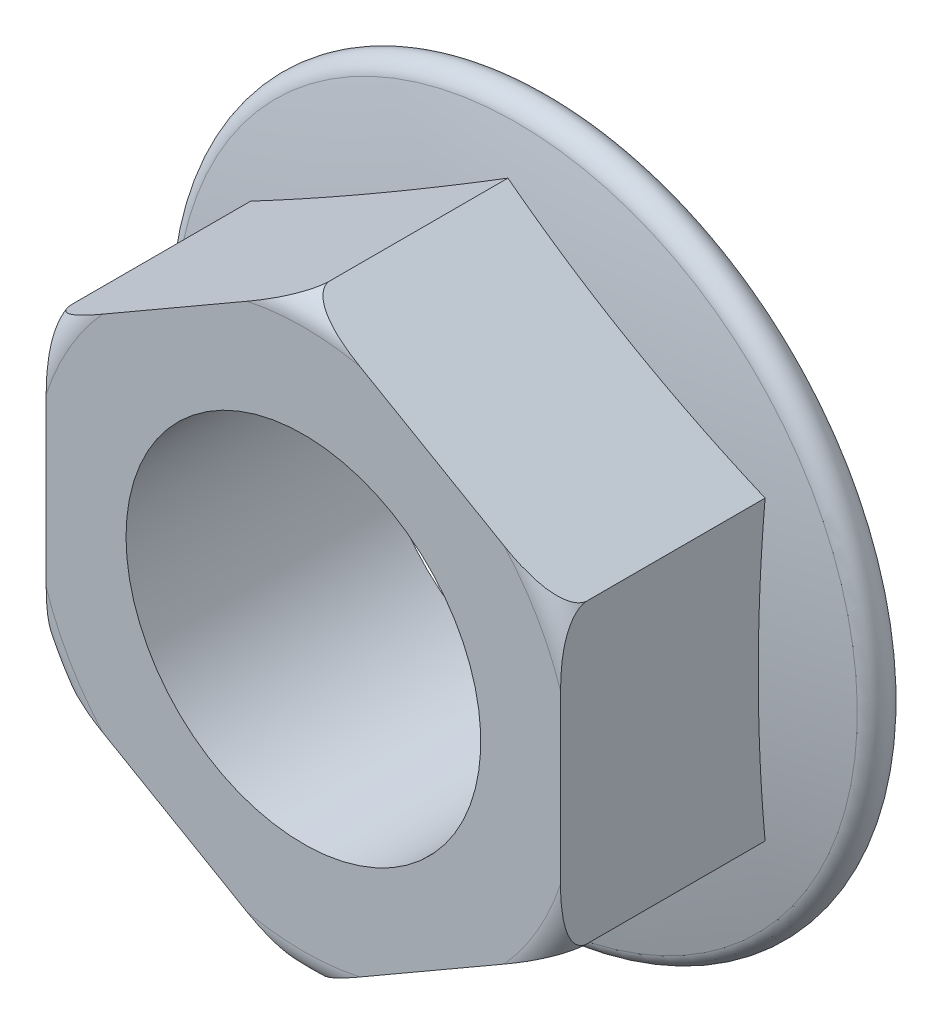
ISO-10303-21;
HEADER;
FILE_DESCRIPTION(('STEP AP214'),'2;1');
FILE_NAME('part.step','',(''),(''),'','','');
FILE_SCHEMA(('AUTOMOTIVE_DESIGN { 1 0 10303 214 1 1 1 1 }'));
ENDSEC;
DATA;
#1=APPLICATION_CONTEXT('core data for automotive mechanical design processes');
#2=APPLICATION_PROTOCOL_DEFINITION('international standard','automotive_design',2000,#1);
#3=PRODUCT_CONTEXT('',#1,'mechanical');
#4=PRODUCT('Part','Part','',(#3));
#5=PRODUCT_RELATED_PRODUCT_CATEGORY('part','',(#4));
#6=PRODUCT_DEFINITION_FORMATION('','',#4);
#7=PRODUCT_DEFINITION_CONTEXT('part definition',#1,'design');
#8=PRODUCT_DEFINITION('design','',#6,#7);
#9=PRODUCT_DEFINITION_SHAPE('','',#8);
#10=(LENGTH_UNIT() NAMED_UNIT(*) SI_UNIT(.MILLI.,.METRE.));
#11=(NAMED_UNIT(*) PLANE_ANGLE_UNIT() SI_UNIT($,.RADIAN.));
#12=(NAMED_UNIT(*) SI_UNIT($,.STERADIAN.) SOLID_ANGLE_UNIT());
#13=UNCERTAINTY_MEASURE_WITH_UNIT(LENGTH_MEASURE(1.E-05),#10,'distance_accuracy_value','');
#14=(GEOMETRIC_REPRESENTATION_CONTEXT(3) GLOBAL_UNCERTAINTY_ASSIGNED_CONTEXT((#13)) GLOBAL_UNIT_ASSIGNED_CONTEXT((#10,
#11,#12)) REPRESENTATION_CONTEXT('',''));
#15=CARTESIAN_POINT('',(0.,0.,0.));
#16=DIRECTION('',(0.,0.,1.));
#17=DIRECTION('',(1.,0.,0.));
#18=AXIS2_PLACEMENT_3D('',#15,#16,#17);
#19=CARTESIAN_POINT('',(-29.,16.7431578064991,28.));
#20=DIRECTION('',(-0.500000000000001,0.866025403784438,0.));
#21=DIRECTION('',(-0.866025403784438,-0.500000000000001,0.));
#22=AXIS2_PLACEMENT_3D('',#19,#20,#21);
#23=PLANE('',#22);
#24=DIRECTION('',(0.,0.,-1.));
#25=VECTOR('',#24,1.);
#26=CARTESIAN_POINT('',(-29.,16.7431578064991,28.));
#27=LINE('',#26,#25);
#28=CARTESIAN_POINT('',(-29.,16.7431578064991,25.));
#29=VERTEX_POINT('',#28);
#30=CARTESIAN_POINT('',(-29.,16.7431578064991,4.9357094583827));
#31=VERTEX_POINT('',#30);
#32=EDGE_CURVE('E156',#29,#31,#27,.T.);
#33=ORIENTED_EDGE('',*,*,#32,.F.);
#34=CARTESIAN_POINT('',(-28.999999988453,16.7431578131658,24.9998));
#35=CARTESIAN_POINT('',(-29.0000138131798,16.743149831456,25.0448703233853));
#36=CARTESIAN_POINT('',(-28.9982497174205,16.7441683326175,25.0899156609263));
#37=CARTESIAN_POINT('',(-28.9912582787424,16.7482048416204,25.1796102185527));
#38=CARTESIAN_POINT('',(-28.9860337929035,16.7512211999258,25.2242597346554));
#39=CARTESIAN_POINT('',(-28.9654326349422,16.7631152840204,25.3563825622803));
#40=CARTESIAN_POINT('',(-28.9451245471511,16.7748401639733,25.4428802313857));
#41=CARTESIAN_POINT('',(-28.8930581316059,16.8049007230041,25.6107147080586));
#42=CARTESIAN_POINT('',(-28.8613342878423,16.8232164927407,25.6920661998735));
#43=CARTESIAN_POINT('',(-28.7884235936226,16.8653115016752,25.849039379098));
#44=CARTESIAN_POINT('',(-28.7472155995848,16.8891029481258,25.9246477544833));
#45=CARTESIAN_POINT('',(-28.6262583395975,16.9589376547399,26.1197443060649));
#46=CARTESIAN_POINT('',(-28.5395489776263,17.0089993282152,26.2334654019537));
#47=CARTESIAN_POINT('',(-28.3520638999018,17.1172438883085,26.4442712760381));
#48=CARTESIAN_POINT('',(-28.2512447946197,17.1754518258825,26.5413025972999));
#49=CARTESIAN_POINT('',(-28.0532804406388,17.2897465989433,26.7097616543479));
#50=CARTESIAN_POINT('',(-27.9571872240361,17.3452260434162,26.7828687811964));
#51=CARTESIAN_POINT('',(-27.7598864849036,17.4591376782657,26.9193203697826));
#52=CARTESIAN_POINT('',(-27.6586749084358,17.5175722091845,26.9826569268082));
#53=CARTESIAN_POINT('',(-27.4525625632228,17.6365712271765,27.1008331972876));
#54=CARTESIAN_POINT('',(-27.3476596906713,17.6971369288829,27.1556679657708));
#55=CARTESIAN_POINT('',(-27.1352224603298,17.8197876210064,27.2578729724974));
#56=CARTESIAN_POINT('',(-27.0276888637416,17.8818721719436,27.3052453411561));
#57=CARTESIAN_POINT('',(-26.7779869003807,18.0260376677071,27.406739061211));
#58=CARTESIAN_POINT('',(-26.6351326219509,18.1085146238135,27.4586024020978));
#59=CARTESIAN_POINT('',(-26.3470918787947,18.2748150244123,27.5529404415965));
#60=CARTESIAN_POINT('',(-26.2019044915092,18.3586390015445,27.5954113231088));
#61=CARTESIAN_POINT('',(-25.909729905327,18.5273260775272,27.6723130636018));
#62=CARTESIAN_POINT('',(-25.7627403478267,18.6121905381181,27.706731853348));
#63=CARTESIAN_POINT('',(-25.4676529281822,18.7825593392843,27.7685346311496));
#64=CARTESIAN_POINT('',(-25.3195549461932,18.8680637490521,27.7959178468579));
#65=CARTESIAN_POINT('',(-25.0215320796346,19.0401273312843,27.8447263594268));
#66=CARTESIAN_POINT('',(-24.8716017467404,19.1266896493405,27.8661067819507));
#67=CARTESIAN_POINT('',(-24.5712327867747,19.3001077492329,27.9034285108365));
#68=CARTESIAN_POINT('',(-24.4207941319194,19.3869635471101,27.9193695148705));
#69=CARTESIAN_POINT('',(-24.1197601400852,19.5607656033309,27.9464750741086));
#70=CARTESIAN_POINT('',(-23.9691651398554,19.6477116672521,27.9576446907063));
#71=CARTESIAN_POINT('',(-23.6678103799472,19.8216989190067,27.9758213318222));
#72=CARTESIAN_POINT('',(-23.5170506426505,19.9087400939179,27.9828288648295));
#73=CARTESIAN_POINT('',(-23.0447885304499,20.181400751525,27.9991043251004));
#74=CARTESIAN_POINT('',(-22.7231181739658,20.3671172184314,28.0019573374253));
#75=CARTESIAN_POINT('',(-22.0798517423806,20.7385072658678,27.9956381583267));
#76=CARTESIAN_POINT('',(-21.7582556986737,20.9241808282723,27.9864633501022));
#77=CARTESIAN_POINT('',(-21.1150544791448,21.2955332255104,27.9598292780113));
#78=CARTESIAN_POINT('',(-20.793449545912,21.481211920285,27.9423627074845));
#79=CARTESIAN_POINT('',(-20.1504642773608,21.852439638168,27.9025308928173));
#80=CARTESIAN_POINT('',(-19.8290839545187,22.0379886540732,27.8801653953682));
#81=CARTESIAN_POINT('',(-19.1861599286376,22.4091810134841,27.8336489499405));
#82=CARTESIAN_POINT('',(-18.8646163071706,22.5948243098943,27.8094965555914));
#83=CARTESIAN_POINT('',(-18.2214588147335,22.9661514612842,27.7623441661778));
#84=CARTESIAN_POINT('',(-17.8998449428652,23.1518353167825,27.7393441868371));
#85=CARTESIAN_POINT('',(-17.256666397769,23.5231746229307,27.6971571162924));
#86=CARTESIAN_POINT('',(-16.9351018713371,23.7088299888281,27.6779671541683));
#87=CARTESIAN_POINT('',(-16.2917439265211,24.0802728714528,27.6455841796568));
#88=CARTESIAN_POINT('',(-15.9699505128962,24.2660603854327,27.6323910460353));
#89=CARTESIAN_POINT('',(-15.3272649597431,24.6371150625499,27.6135811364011));
#90=CARTESIAN_POINT('',(-15.0063733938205,24.822381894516,27.6079392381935));
#91=CARTESIAN_POINT('',(-14.3645593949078,25.1929333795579,27.6048204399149));
#92=CARTESIAN_POINT('',(-14.0436369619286,25.3782180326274,27.6073435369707));
#93=CARTESIAN_POINT('',(-13.4017883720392,25.748789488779,27.620256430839));
#94=CARTESIAN_POINT('',(-13.0808622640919,25.9340762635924,27.6306493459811));
#95=CARTESIAN_POINT('',(-12.4392280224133,26.3045239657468,27.6580822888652));
#96=CARTESIAN_POINT('',(-12.118519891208,26.4896848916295,27.6751223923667));
#97=CARTESIAN_POINT('',(-11.4770924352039,26.860013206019,27.7139025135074));
#98=CARTESIAN_POINT('',(-11.1563732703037,27.0451805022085,27.7356459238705));
#99=CARTESIAN_POINT('',(-10.5150515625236,27.4154477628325,27.7813504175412));
#100=CARTESIAN_POINT('',(-10.1944490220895,27.6005477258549,27.8053115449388));
#101=CARTESIAN_POINT('',(-9.55327457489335,27.9707299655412,27.85264559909));
#102=CARTESIAN_POINT('',(-9.23270267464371,28.1558122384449,27.8760186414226));
#103=CARTESIAN_POINT('',(-8.5913810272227,28.5260794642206,27.9191574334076));
#104=CARTESIAN_POINT('',(-8.27063128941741,28.711264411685,27.9389233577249));
#105=CARTESIAN_POINT('',(-7.73376299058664,29.0212254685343,27.9662488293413));
#106=CARTESIAN_POINT('',(-7.51771836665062,29.1459588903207,27.975686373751));
#107=CARTESIAN_POINT('',(-7.08555125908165,29.3954706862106,27.9903736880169));
#108=CARTESIAN_POINT('',(-6.8694287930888,29.5202490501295,27.9956241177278));
#109=CARTESIAN_POINT('',(-6.43669346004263,29.7700889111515,28.0007856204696));
#110=CARTESIAN_POINT('',(-6.22008048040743,29.8951504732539,28.0006859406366));
#111=CARTESIAN_POINT('',(-5.78691897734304,30.1452363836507,27.9938255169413));
#112=CARTESIAN_POINT('',(-5.5703704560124,30.2702607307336,27.9870645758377));
#113=CARTESIAN_POINT('',(-5.11034633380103,30.535855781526,27.9640544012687));
#114=CARTESIAN_POINT('',(-4.86690835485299,30.6764047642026,27.9467190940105));
#115=CARTESIAN_POINT('',(-4.38098605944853,30.9569521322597,27.8992780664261));
#116=CARTESIAN_POINT('',(-4.13850157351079,31.0969506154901,27.8691747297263));
#117=CARTESIAN_POINT('',(-3.655895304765,31.3755834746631,27.793219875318));
#118=CARTESIAN_POINT('',(-3.41576922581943,31.5142203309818,27.7474066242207));
#119=CARTESIAN_POINT('',(-3.05825677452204,31.720630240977,27.663900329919));
#120=CARTESIAN_POINT('',(-2.93956723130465,31.7891556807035,27.6336117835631));
#121=CARTESIAN_POINT('',(-2.70336233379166,31.9255286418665,27.5674677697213));
#122=CARTESIAN_POINT('',(-2.58584688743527,31.9933762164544,27.5316127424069));
#123=CARTESIAN_POINT('',(-2.30460011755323,32.1557541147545,27.4376528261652));
#124=CARTESIAN_POINT('',(-2.14162608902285,32.2498472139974,27.3764458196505));
#125=CARTESIAN_POINT('',(-1.8202700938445,32.4353821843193,27.2389479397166));
#126=CARTESIAN_POINT('',(-1.66189318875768,32.5268211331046,27.1626411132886));
#127=CARTESIAN_POINT('',(-1.35135804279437,32.7061086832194,26.9909536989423));
#128=CARTESIAN_POINT('',(-1.19925496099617,32.7939254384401,26.8954351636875));
#129=CARTESIAN_POINT('',(-0.9807172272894,32.9200982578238,26.7349938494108));
#130=CARTESIAN_POINT('',(-0.909522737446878,32.9612024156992,26.6787002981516));
#131=CARTESIAN_POINT('',(-0.771273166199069,33.0410208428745,26.5597408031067));
#132=CARTESIAN_POINT('',(-0.704215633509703,33.0797365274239,26.4970786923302));
#133=CARTESIAN_POINT('',(-0.567306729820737,33.1587809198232,26.3563174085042));
#134=CARTESIAN_POINT('',(-0.49817585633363,33.1986936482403,26.2772682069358));
#135=CARTESIAN_POINT('',(-0.369214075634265,33.2731497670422,26.1094435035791));
#136=CARTESIAN_POINT('',(-0.309387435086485,33.3076906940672,26.0206635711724));
#137=CARTESIAN_POINT('',(-0.201745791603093,33.3698376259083,25.8318463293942));
#138=CARTESIAN_POINT('',(-0.154100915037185,33.3973454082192,25.7316751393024));
#139=CARTESIAN_POINT('',(-0.0957732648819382,33.4310208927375,25.5751409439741));
#140=CARTESIAN_POINT('',(-0.0785329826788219,33.4409745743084,25.5219814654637));
#141=CARTESIAN_POINT('',(-0.0488800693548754,33.4580946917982,25.413910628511));
#142=CARTESIAN_POINT('',(-0.0364639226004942,33.4652631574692,25.3590005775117));
#143=CARTESIAN_POINT('',(-0.017876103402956,33.4759948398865,25.2535876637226));
#144=CARTESIAN_POINT('',(-0.0111982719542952,33.479850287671,25.2032036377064));
#145=CARTESIAN_POINT('',(-0.00224182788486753,33.4850212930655,25.1018200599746));
#146=CARTESIAN_POINT('',(2.81828445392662E-05,33.4863318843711,25.0508194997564));
#147=CARTESIAN_POINT('',(-1.15470004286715E-08,33.4863156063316,24.9998));
#148=B_SPLINE_CURVE_WITH_KNOTS('',3,(#34,#35,#36,#37,#38,#39,#40,#41,#42,#43,#44,#45,#46,#47,
#48,#49,#50,#51,#52,#53,#54,#55,#56,#57,#58,#59,#60,#61,#62,#63,#64,#65,#66,#67,#68,#69,#70,#71,
#72,#73,#74,#75,#76,#77,#78,#79,#80,#81,#82,#83,#84,#85,#86,#87,#88,#89,#90,#91,#92,#93,#94,#95,
#96,#97,#98,#99,#100,#101,#102,#103,#104,#105,#106,#107,#108,#109,#110,#111,#112,#113,#114,#115,
#116,#117,#118,#119,#120,#121,#122,#123,#124,#125,#126,#127,#128,#129,#130,#131,#132,#133,#134,
#135,#136,#137,#138,#139,#140,#141,#142,#143,#144,#145,#146,#147),.UNSPECIFIED.,.F.,.F.,(4,2,2,
2,2,2,2,2,2,2,2,2,2,2,2,2,2,2,2,2,2,2,2,2,2,2,2,2,2,2,2,2,2,2,2,2,2,2,2,2,2,2,2,2,2,2,2,2,2,2,2,
2,2,2,2,2,4),(0.,0.135117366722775,0.270123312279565,0.537620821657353,0.804316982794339,
1.07161356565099,1.52355235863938,1.97691278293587,2.3749707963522,2.77334918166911,
3.17195841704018,3.57045364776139,4.08884962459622,4.60745589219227,5.1268345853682,
5.64627027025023,6.16949148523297,6.69274177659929,7.21543562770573,7.7380656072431,
8.8520844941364,9.96634578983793,11.0815907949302,12.1968934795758,13.3131090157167,
14.4293397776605,15.5447262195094,16.6600901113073,17.771733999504,18.8833774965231,
19.9954617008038,21.1075585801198,22.2204603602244,23.3333842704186,24.4460877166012,
25.5587372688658,26.3076469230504,27.0564385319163,27.8067351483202,28.5570539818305,
29.401709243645,30.2462068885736,31.0886619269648,31.5096372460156,31.9305792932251,
32.5236991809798,33.1174490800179,33.7156251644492,34.0142762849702,34.3127487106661,
34.6489957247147,34.9853964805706,35.3262661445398,35.4963097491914,35.6662291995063,
35.8188900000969,35.9718484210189),.UNSPECIFIED.);
#149=CARTESIAN_POINT('',(-22.6431922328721,20.4132624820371,28.));
#150=VERTEX_POINT('',#149);
#151=EDGE_CURVE('E211',#29,#150,#148,.T.);
#152=ORIENTED_EDGE('',*,*,#151,.T.);
#153=DIRECTION('',(0.866025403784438,0.500000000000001,0.));
#154=VECTOR('',#153,1.);
#155=CARTESIAN_POINT('',(-29.,16.7431578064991,28.));
#156=LINE('',#155,#154);
#157=CARTESIAN_POINT('',(-6.35680776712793,29.8162109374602,28.));
#158=VERTEX_POINT('',#157);
#159=EDGE_CURVE('E173',#150,#158,#156,.T.);
#160=ORIENTED_EDGE('',*,*,#159,.T.);
#161=CARTESIAN_POINT('',(0.,33.4863156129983,25.));
#162=VERTEX_POINT('',#161);
#163=EDGE_CURVE('E245',#158,#162,#148,.T.);
#164=ORIENTED_EDGE('',*,*,#163,.T.);
#165=DIRECTION('',(0.,0.,-1.));
#166=VECTOR('',#165,1.);
#167=CARTESIAN_POINT('',(0.,33.4863156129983,28.));
#168=LINE('',#167,#166);
#169=CARTESIAN_POINT('',(0.,33.4863156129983,4.9357094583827));
#170=VERTEX_POINT('',#169);
#171=EDGE_CURVE('E145',#162,#170,#168,.T.);
#172=ORIENTED_EDGE('',*,*,#171,.T.);
#173=CARTESIAN_POINT('',(-14.5,25.1147367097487,-176.5));
#174=DIRECTION('',(-0.500000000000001,0.866025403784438,0.));
#175=DIRECTION('',(-0.866025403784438,-0.500000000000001,0.));
#176=AXIS2_PLACEMENT_3D('',#173,#174,#175);
#177=CIRCLE('',#176,182.206613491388);
#178=EDGE_CURVE('E192',#170,#31,#177,.F.);
#179=ORIENTED_EDGE('',*,*,#178,.T.);
#180=EDGE_LOOP('',(#33,#152,#160,#164,#172,#179));
#181=FACE_BOUND('',#180,.T.);
#182=ADVANCED_FACE('F31',(#181),#23,.T.);
#183=CARTESIAN_POINT('',(-29.,-16.743157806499,28.));
#184=DIRECTION('',(-1.,0.,0.));
#185=DIRECTION('',(0.,-1.,0.));
#186=AXIS2_PLACEMENT_3D('',#183,#184,#185);
#187=PLANE('',#186);
#188=DIRECTION('',(0.,1.,0.));
#189=VECTOR('',#188,1.);
#190=CARTESIAN_POINT('',(-29.,-16.743157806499,28.));
#191=LINE('',#190,#189);
#192=CARTESIAN_POINT('',(-29.,-9.40294845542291,28.));
#193=VERTEX_POINT('',#192);
#194=CARTESIAN_POINT('',(-29.,9.40294845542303,28.));
#195=VERTEX_POINT('',#194);
#196=EDGE_CURVE('E149',#193,#195,#191,.T.);
#197=ORIENTED_EDGE('',*,*,#196,.T.);
#198=CARTESIAN_POINT('',(-29.,0.,27.6059289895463));
#199=CARTESIAN_POINT('',(-29.,0.249997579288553,27.6059291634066));
#200=CARTESIAN_POINT('',(-29.,0.499995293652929,27.6077813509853));
#201=CARTESIAN_POINT('',(-29.,0.999937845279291,27.6150890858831));
#202=CARTESIAN_POINT('',(-29.,1.24988268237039,27.6205446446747));
#203=CARTESIAN_POINT('',(-29.,1.74980508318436,27.6347689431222));
#204=CARTESIAN_POINT('',(-29.,1.99978259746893,27.6435393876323));
#205=CARTESIAN_POINT('',(-29.,2.499620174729,27.6639198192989));
#206=CARTESIAN_POINT('',(-29.,2.74948023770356,27.6755298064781));
#207=CARTESIAN_POINT('',(-29.,3.49971615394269,27.7137737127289));
#208=CARTESIAN_POINT('',(-29.,3.99991428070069,27.7437941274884));
#209=CARTESIAN_POINT('',(-29.,5.00002875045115,27.8067335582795));
#210=CARTESIAN_POINT('',(-29.,5.49994512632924,27.8396520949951));
#211=CARTESIAN_POINT('',(-29.,6.45832868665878,27.8986467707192));
#212=CARTESIAN_POINT('',(-29.,6.91677372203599,27.9250646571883));
#213=CARTESIAN_POINT('',(-29.,7.83428978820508,27.9682914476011));
#214=CARTESIAN_POINT('',(-29.,8.29336094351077,27.985098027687));
#215=CARTESIAN_POINT('',(-29.,8.9820770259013,27.998003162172));
#216=CARTESIAN_POINT('',(-29.,9.21160030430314,28.0002552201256));
#217=CARTESIAN_POINT('',(-29.,9.67063588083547,27.9996984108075));
#218=CARTESIAN_POINT('',(-29.,9.90014817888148,27.9968898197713));
#219=CARTESIAN_POINT('',(-29.,10.3589252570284,27.9851606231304));
#220=CARTESIAN_POINT('',(-29.,10.5881901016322,27.9762427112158));
#221=CARTESIAN_POINT('',(-29.,11.0463072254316,27.9510973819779));
#222=CARTESIAN_POINT('',(-29.,11.2751595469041,27.9348707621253));
#223=CARTESIAN_POINT('',(-29.,11.7335875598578,27.8935758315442));
#224=CARTESIAN_POINT('',(-29.,11.9631582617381,27.8684506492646));
#225=CARTESIAN_POINT('',(-29.,12.4209875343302,27.8076629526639));
#226=CARTESIAN_POINT('',(-29.,12.6492457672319,27.7719978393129));
#227=CARTESIAN_POINT('',(-29.,13.1029771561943,27.6881107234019));
#228=CARTESIAN_POINT('',(-29.,13.3284553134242,27.6399163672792));
#229=CARTESIAN_POINT('',(-29.,13.7755247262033,27.5282973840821));
#230=CARTESIAN_POINT('',(-29.,13.9971183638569,27.4648824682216));
#231=CARTESIAN_POINT('',(-29.,14.4218033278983,27.3234095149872));
#232=CARTESIAN_POINT('',(-29.,14.625230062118,27.2463897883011));
#233=CARTESIAN_POINT('',(-29.,14.9236821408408,27.1153231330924));
#234=CARTESIAN_POINT('',(-29.,15.0221104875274,27.0690111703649));
#235=CARTESIAN_POINT('',(-29.,15.216002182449,26.9705696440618));
#236=CARTESIAN_POINT('',(-29.,15.3114660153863,26.9184410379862));
#237=CARTESIAN_POINT('',(-29.,15.5601100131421,26.771245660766));
#238=CARTESIAN_POINT('',(-29.,15.709999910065,26.670470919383));
#239=CARTESIAN_POINT('',(-29.,15.9928358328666,26.4473752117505));
#240=CARTESIAN_POINT('',(-29.,16.1258307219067,26.3251189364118));
#241=CARTESIAN_POINT('',(-29.,16.3155704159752,26.1106007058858));
#242=CARTESIAN_POINT('',(-29.,16.3813295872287,26.0263586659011));
#243=CARTESIAN_POINT('',(-29.,16.4996420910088,25.8489982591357));
#244=CARTESIAN_POINT('',(-29.,16.5522117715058,25.7558910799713));
#245=CARTESIAN_POINT('',(-29.,16.6334238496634,25.5766926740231));
#246=CARTESIAN_POINT('',(-29.,16.6644996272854,25.491716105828));
#247=CARTESIAN_POINT('',(-29.,16.7119761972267,25.3177396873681));
#248=CARTESIAN_POINT('',(-29.,16.7283887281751,25.2287431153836));
#249=CARTESIAN_POINT('',(-29.,16.7450733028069,25.0488702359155));
#250=CARTESIAN_POINT('',(-29.,16.7452827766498,24.9579879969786));
#251=CARTESIAN_POINT('',(-29.,16.7293790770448,24.7776647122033));
#252=CARTESIAN_POINT('',(-29.,16.7132607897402,24.6882241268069));
#253=CARTESIAN_POINT('',(-29.,16.6675260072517,24.518259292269));
#254=CARTESIAN_POINT('',(-29.,16.6387059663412,24.4375155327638));
#255=CARTESIAN_POINT('',(-29.,16.5698570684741,24.2810186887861));
#256=CARTESIAN_POINT('',(-29.,16.5298244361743,24.2052672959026));
#257=CARTESIAN_POINT('',(-29.,16.4142545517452,24.0162364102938));
#258=CARTESIAN_POINT('',(-29.,16.3317184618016,23.9072440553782));
#259=CARTESIAN_POINT('',(-29.,16.1506703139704,23.7033959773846));
#260=CARTESIAN_POINT('',(-29.,16.0521113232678,23.6085834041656));
#261=CARTESIAN_POINT('',(-29.,15.8605844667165,23.4458330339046));
#262=CARTESIAN_POINT('',(-29.,15.769183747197,23.3760147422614));
#263=CARTESIAN_POINT('',(-29.,15.5806620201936,23.2445044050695));
#264=CARTESIAN_POINT('',(-29.,15.4835368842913,23.1828183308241));
#265=CARTESIAN_POINT('',(-29.,15.2849615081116,23.0666138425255));
#266=CARTESIAN_POINT('',(-29.,15.1835058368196,23.0121048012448));
#267=CARTESIAN_POINT('',(-29.,14.9773813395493,22.9094898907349));
#268=CARTESIAN_POINT('',(-29.,14.87271127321,22.8613865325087));
#269=CARTESIAN_POINT('',(-29.,14.6593913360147,22.7702187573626));
#270=CARTESIAN_POINT('',(-29.,14.5507055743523,22.7272388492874));
#271=CARTESIAN_POINT('',(-29.,14.3314002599,22.6465060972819));
#272=CARTESIAN_POINT('',(-29.,14.2207803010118,22.6087543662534));
#273=CARTESIAN_POINT('',(-29.,13.8865189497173,22.5024446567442));
#274=CARTESIAN_POINT('',(-29.,13.6606372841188,22.4408987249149));
#275=CARTESIAN_POINT('',(-29.,13.2049175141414,22.3328786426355));
#276=CARTESIAN_POINT('',(-29.,12.9750722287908,22.2864357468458));
#277=CARTESIAN_POINT('',(-29.,12.6288052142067,22.2262196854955));
#278=CARTESIAN_POINT('',(-29.,12.5131775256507,22.2077276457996));
#279=CARTESIAN_POINT('',(-29.,12.2815022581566,22.1736109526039));
#280=CARTESIAN_POINT('',(-29.,12.1654546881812,22.1579862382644));
#281=CARTESIAN_POINT('',(-29.,11.8040733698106,22.1134553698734));
#282=CARTESIAN_POINT('',(-29.,11.558179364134,22.0890522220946));
#283=CARTESIAN_POINT('',(-29.,11.0656089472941,22.0498537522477));
#284=CARTESIAN_POINT('',(-29.,10.8189323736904,22.0350605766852));
#285=CARTESIAN_POINT('',(-29.,10.3250580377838,22.0134232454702));
#286=CARTESIAN_POINT('',(-29.,10.0778600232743,22.0065850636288));
#287=CARTESIAN_POINT('',(-29.,9.58336193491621,21.999457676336));
#288=CARTESIAN_POINT('',(-29.,9.33606185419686,21.9991690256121));
#289=CARTESIAN_POINT('',(-29.,8.59232708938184,22.0062345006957));
#290=CARTESIAN_POINT('',(-29.,8.09597812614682,22.0215838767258));
#291=CARTESIAN_POINT('',(-29.,7.10409950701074,22.0647128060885));
#292=CARTESIAN_POINT('',(-29.,6.60856961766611,22.0924878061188));
#293=CARTESIAN_POINT('',(-29.,5.61622251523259,22.1528832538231));
#294=CARTESIAN_POINT('',(-29.,5.11940628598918,22.1855189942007));
#295=CARTESIAN_POINT('',(-29.,4.12557711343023,22.248476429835));
#296=CARTESIAN_POINT('',(-29.,3.62856415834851,22.2787979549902));
#297=CARTESIAN_POINT('',(-29.,2.88350696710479,22.3179173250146));
#298=CARTESIAN_POINT('',(-29.,2.63563406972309,22.3298823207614));
#299=CARTESIAN_POINT('',(-29.,2.13977426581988,22.3511181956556));
#300=CARTESIAN_POINT('',(-29.,1.89178736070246,22.360389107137));
#301=CARTESIAN_POINT('',(-29.,1.39573250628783,22.3757457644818));
#302=CARTESIAN_POINT('',(-29.,1.14766456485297,22.3818317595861));
#303=CARTESIAN_POINT('',(-29.,0.651466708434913,22.3904973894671));
#304=CARTESIAN_POINT('',(-29.,0.403336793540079,22.3930770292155));
#305=CARTESIAN_POINT('',(-29.,-0.0901937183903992,22.3945829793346));
#306=CARTESIAN_POINT('',(-29.,-0.33559419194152,22.3935493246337));
#307=CARTESIAN_POINT('',(-29.,-0.826354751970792,22.3879721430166));
#308=CARTESIAN_POINT('',(-29.,-1.07171483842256,22.3834286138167));
#309=CARTESIAN_POINT('',(-29.,-1.56236735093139,22.3710671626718));
#310=CARTESIAN_POINT('',(-29.,-1.80765977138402,22.3632490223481));
#311=CARTESIAN_POINT('',(-29.,-2.29813785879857,22.3447469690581));
#312=CARTESIAN_POINT('',(-29.,-2.54332352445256,22.3340630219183));
#313=CARTESIAN_POINT('',(-29.,-3.28014569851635,22.2984285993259));
#314=CARTESIAN_POINT('',(-29.,-3.77160667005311,22.2699376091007));
#315=CARTESIAN_POINT('',(-29.,-4.75424958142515,22.2091385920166));
#316=CARTESIAN_POINT('',(-29.,-5.24543153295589,22.1768307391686));
#317=CARTESIAN_POINT('',(-29.,-6.22732013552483,22.1151194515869));
#318=CARTESIAN_POINT('',(-29.,-6.71802653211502,22.0857121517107));
#319=CARTESIAN_POINT('',(-29.,-7.70015387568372,22.0370260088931));
#320=CARTESIAN_POINT('',(-29.,-8.19157498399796,22.0177499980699));
#321=CARTESIAN_POINT('',(-29.,-8.92821435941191,22.0026318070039));
#322=CARTESIAN_POINT('',(-29.,-9.17328170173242,21.999885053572));
#323=CARTESIAN_POINT('',(-29.,-9.66340753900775,22.0001224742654));
#324=CARTESIAN_POINT('',(-29.,-9.90846603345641,22.0031062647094));
#325=CARTESIAN_POINT('',(-29.,-10.398263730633,22.0160836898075));
#326=CARTESIAN_POINT('',(-29.,-10.6430030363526,22.0260732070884));
#327=CARTESIAN_POINT('',(-29.,-11.1319742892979,22.0545293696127));
#328=CARTESIAN_POINT('',(-29.,-11.3762063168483,22.072994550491));
#329=CARTESIAN_POINT('',(-29.,-11.7434026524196,22.1085142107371));
#330=CARTESIAN_POINT('',(-29.,-11.8667377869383,22.121768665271));
#331=CARTESIAN_POINT('',(-29.,-12.1130654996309,22.1511698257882));
#332=CARTESIAN_POINT('',(-29.,-12.2360580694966,22.1673166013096));
#333=CARTESIAN_POINT('',(-29.,-12.6045524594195,22.2205488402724));
#334=CARTESIAN_POINT('',(-29.,-12.8493903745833,22.2624095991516));
#335=CARTESIAN_POINT('',(-29.,-13.3348956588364,22.3614141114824));
#336=CARTESIAN_POINT('',(-29.,-13.5755769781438,22.418487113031));
#337=CARTESIAN_POINT('',(-29.,-13.9325008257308,22.5183193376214));
#338=CARTESIAN_POINT('',(-29.,-14.0507449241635,22.5539497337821));
#339=CARTESIAN_POINT('',(-29.,-14.2854864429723,22.6305382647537));
#340=CARTESIAN_POINT('',(-29.,-14.4019840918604,22.6714956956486));
#341=CARTESIAN_POINT('',(-29.,-14.6747541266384,22.7754146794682));
#342=CARTESIAN_POINT('',(-29.,-14.8300611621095,22.840957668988));
#343=CARTESIAN_POINT('',(-29.,-15.1347119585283,22.985367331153));
#344=CARTESIAN_POINT('',(-29.,-15.2840474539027,23.0642517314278));
#345=CARTESIAN_POINT('',(-29.,-15.5744814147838,23.2385415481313));
#346=CARTESIAN_POINT('',(-29.,-15.7155071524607,23.3340701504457));
#347=CARTESIAN_POINT('',(-29.,-15.9825330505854,23.5443053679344));
#348=CARTESIAN_POINT('',(-29.,-16.1085679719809,23.6589660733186));
#349=CARTESIAN_POINT('',(-29.,-16.293851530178,23.8631246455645));
#350=CARTESIAN_POINT('',(-29.,-16.3604217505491,23.9459352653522));
#351=CARTESIAN_POINT('',(-29.,-16.4809628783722,24.1204092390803));
#352=CARTESIAN_POINT('',(-29.,-16.5349375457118,24.2120699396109));
#353=CARTESIAN_POINT('',(-29.,-16.6269461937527,24.4046802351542));
#354=CARTESIAN_POINT('',(-29.,-16.664770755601,24.5057323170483));
#355=CARTESIAN_POINT('',(-29.,-16.7193577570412,24.7133604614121));
#356=CARTESIAN_POINT('',(-29.,-16.7361589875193,24.8199259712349));
#357=CARTESIAN_POINT('',(-29.,-16.7458428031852,25.0184812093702));
#358=CARTESIAN_POINT('',(-29.,-16.7418603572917,25.1103265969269));
#359=CARTESIAN_POINT('',(-29.,-16.7174644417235,25.2918101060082));
#360=CARTESIAN_POINT('',(-29.,-16.6970448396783,25.3814473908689));
#361=CARTESIAN_POINT('',(-29.,-16.6432503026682,25.550968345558));
#362=CARTESIAN_POINT('',(-29.,-16.6106888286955,25.6311164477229));
#363=CARTESIAN_POINT('',(-29.,-16.5347877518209,25.7860594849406));
#364=CARTESIAN_POINT('',(-29.,-16.491445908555,25.8608533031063));
#365=CARTESIAN_POINT('',(-29.,-16.3646348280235,26.0520652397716));
#366=CARTESIAN_POINT('',(-29.,-16.2735469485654,26.1634229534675));
#367=CARTESIAN_POINT('',(-29.,-16.0752419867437,26.37079164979));
#368=CARTESIAN_POINT('',(-29.,-15.9679737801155,26.4667519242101));
#369=CARTESIAN_POINT('',(-29.,-15.7585039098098,26.6324059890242));
#370=CARTESIAN_POINT('',(-29.,-15.6576962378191,26.7038962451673));
#371=CARTESIAN_POINT('',(-29.,-15.450264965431,26.8379630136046));
#372=CARTESIAN_POINT('',(-29.,-15.3436369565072,26.9005326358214));
#373=CARTESIAN_POINT('',(-29.,-15.1260544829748,27.0178761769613));
#374=CARTESIAN_POINT('',(-29.,-15.0150950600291,27.0726408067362));
#375=CARTESIAN_POINT('',(-29.,-14.790002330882,27.1752673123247));
#376=CARTESIAN_POINT('',(-29.,-14.6758677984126,27.2231264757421));
#377=CARTESIAN_POINT('',(-29.,-14.4408829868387,27.3144262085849));
#378=CARTESIAN_POINT('',(-29.,-14.3199418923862,27.3576315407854));
#379=CARTESIAN_POINT('',(-29.,-14.0761272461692,27.4382285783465));
#380=CARTESIAN_POINT('',(-29.,-13.9532532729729,27.4756189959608));
#381=CARTESIAN_POINT('',(-29.,-13.5822534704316,27.5801147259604));
#382=CARTESIAN_POINT('',(-29.,-13.3319363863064,27.639474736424));
#383=CARTESIAN_POINT('',(-29.,-12.8274614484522,27.7417617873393));
#384=CARTESIAN_POINT('',(-29.,-12.5732958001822,27.7846489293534));
#385=CARTESIAN_POINT('',(-29.,-12.1907563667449,27.8387989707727));
#386=CARTESIAN_POINT('',(-29.,-12.0630743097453,27.8551481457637));
#387=CARTESIAN_POINT('',(-29.,-11.8073561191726,27.8847759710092));
#388=CARTESIAN_POINT('',(-29.,-11.6793199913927,27.8980546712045));
#389=CARTESIAN_POINT('',(-29.,-11.3118599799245,27.9321463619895));
#390=CARTESIAN_POINT('',(-29.,-11.0721137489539,27.9495090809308));
#391=CARTESIAN_POINT('',(-29.,-10.5921604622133,27.9761862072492));
#392=CARTESIAN_POINT('',(-29.,-10.3519533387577,27.9854993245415));
#393=CARTESIAN_POINT('',(-29.,-9.87125333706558,27.997455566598));
#394=CARTESIAN_POINT('',(-29.,-9.63076037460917,28.000095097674));
#395=CARTESIAN_POINT('',(-29.,-9.14977108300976,27.9998998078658));
#396=CARTESIAN_POINT('',(-29.,-8.90927475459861,27.9970646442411));
#397=CARTESIAN_POINT('',(-29.,-8.18666788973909,27.9819700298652));
#398=CARTESIAN_POINT('',(-29.,-7.70470367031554,27.9631018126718));
#399=CARTESIAN_POINT('',(-29.,-6.74126107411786,27.9155342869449));
#400=CARTESIAN_POINT('',(-29.,-6.25978277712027,27.8868335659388));
#401=CARTESIAN_POINT('',(-29.,-5.29683045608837,27.8264797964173));
#402=CARTESIAN_POINT('',(-29.,-4.81535650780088,27.7948255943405));
#403=CARTESIAN_POINT('',(-29.,-3.8521613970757,27.7348904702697));
#404=CARTESIAN_POINT('',(-29.,-3.3704402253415,27.7066096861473));
#405=CARTESIAN_POINT('',(-29.,-2.64796678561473,27.6707555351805));
#406=CARTESIAN_POINT('',(-29.,-2.40738116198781,27.6599056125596));
#407=CARTESIAN_POINT('',(-29.,-1.92610502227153,27.6408924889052));
#408=CARTESIAN_POINT('',(-29.,-1.68541450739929,27.6327292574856));
#409=CARTESIAN_POINT('',(-29.,-1.2039596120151,27.6194992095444));
#410=CARTESIAN_POINT('',(-29.,-0.963195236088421,27.6144322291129));
#411=CARTESIAN_POINT('',(-29.,-0.48162061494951,27.6076470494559));
#412=CARTESIAN_POINT('',(-29.,-0.240810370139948,27.6059288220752));
#413=CARTESIAN_POINT('',(-29.,0.,27.6059289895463));
#414=B_SPLINE_CURVE_WITH_KNOTS('',3,(#198,#199,#200,#201,#202,#203,#204,#205,#206,#207,#208,
#209,#210,#211,#212,#213,#214,#215,#216,#217,#218,#219,#220,#221,#222,#223,#224,#225,#226,#227,
#228,#229,#230,#231,#232,#233,#234,#235,#236,#237,#238,#239,#240,#241,#242,#243,#244,#245,#246,
#247,#248,#249,#250,#251,#252,#253,#254,#255,#256,#257,#258,#259,#260,#261,#262,#263,#264,#265,
#266,#267,#268,#269,#270,#271,#272,#273,#274,#275,#276,#277,#278,#279,#280,#281,#282,#283,#284,
#285,#286,#287,#288,#289,#290,#291,#292,#293,#294,#295,#296,#297,#298,#299,#300,#301,#302,#303,
#304,#305,#306,#307,#308,#309,#310,#311,#312,#313,#314,#315,#316,#317,#318,#319,#320,#321,#322,
#323,#324,#325,#326,#327,#328,#329,#330,#331,#332,#333,#334,#335,#336,#337,#338,#339,#340,#341,
#342,#343,#344,#345,#346,#347,#348,#349,#350,#351,#352,#353,#354,#355,#356,#357,#358,#359,#360,
#361,#362,#363,#364,#365,#366,#367,#368,#369,#370,#371,#372,#373,#374,#375,#376,#377,#378,#379,
#380,#381,#382,#383,#384,#385,#386,#387,#388,#389,#390,#391,#392,#393,#394,#395,#396,#397,#398,
#399,#400,#401,#402,#403,#404,#405,#406,#407,#408,#409,#410,#411,#412,#413),.UNSPECIFIED.,.T.,
.F.,(4,2,2,2,2,2,2,2,2,2,2,2,2,2,2,2,2,2,2,2,2,2,2,2,2,2,2,2,2,2,2,2,2,2,2,2,2,2,2,2,2,2,2,2,2,
2,2,2,2,2,2,2,2,2,2,2,2,2,2,2,2,2,2,2,2,2,2,2,2,2,2,2,2,2,2,2,2,2,2,2,2,2,2,2,2,2,2,2,2,2,2,2,2,
2,2,2,2,2,2,2,2,2,2,2,2,2,2,4),(0.,0.749986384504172,1.49997515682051,2.25035017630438,
3.00072520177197,4.5039764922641,6.00697962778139,7.38456734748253,8.7624880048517,
9.45104670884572,10.1395678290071,10.8277855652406,11.5159282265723,12.2085506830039,
12.901344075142,13.5926215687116,14.2834591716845,14.9349942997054,15.2611668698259,
15.5872858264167,16.1276795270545,16.6664729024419,16.986163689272,17.3054562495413,
17.575770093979,17.845867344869,18.117007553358,18.3882327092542,18.6444464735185,
18.900746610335,19.3085581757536,19.7175865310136,20.06214683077,20.4069587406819,
20.7522165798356,21.0976093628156,21.448081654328,21.7986284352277,22.5002433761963,
23.2033011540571,23.5545615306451,23.9058144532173,24.6468628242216,25.3880766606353,
26.129846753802,26.8716796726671,28.3611037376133,29.8499824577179,31.3436484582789,
32.837424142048,33.5818961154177,34.3263591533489,35.0707639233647,35.8151676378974,
36.5513497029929,37.2875322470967,38.0237638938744,38.7600043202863,40.2368082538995,
41.7135448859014,43.1882863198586,44.6634397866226,45.3986355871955,46.1337821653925,
46.8684970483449,47.6030850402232,47.9751908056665,48.3473055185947,49.0920783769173,
49.8334459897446,50.2038271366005,50.5741593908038,51.0793573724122,51.5852319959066,
52.0950233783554,52.6036085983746,52.9214814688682,53.2392593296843,53.5610411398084,
53.8822283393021,54.1565056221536,54.4308852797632,54.689469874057,54.9481082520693,
55.377231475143,55.8077401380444,56.1779629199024,56.5484701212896,56.9194146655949,
57.2905045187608,57.6756137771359,58.060808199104,58.8317927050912,59.604632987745,
59.9907749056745,60.376910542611,61.0978519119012,61.8189088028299,62.5403538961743,
63.2618441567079,64.7086149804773,66.155593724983,67.60314001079,69.0507454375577,
69.77322292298,70.4956922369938,71.2181233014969,71.9405482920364),.UNSPECIFIED.);
#415=EDGE_CURVE('E179',#195,#29,#414,.T.);
#416=ORIENTED_EDGE('',*,*,#415,.T.);
#417=ORIENTED_EDGE('',*,*,#32,.T.);
#418=CARTESIAN_POINT('',(-29.,0.,-176.5));
#419=DIRECTION('',(-1.,0.,0.));
#420=DIRECTION('',(0.,-1.,0.));
#421=AXIS2_PLACEMENT_3D('',#418,#419,#420);
#422=CIRCLE('',#421,182.206613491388);
#423=CARTESIAN_POINT('',(-29.,-16.743157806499,4.9357094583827));
#424=VERTEX_POINT('',#423);
#425=EDGE_CURVE('E195',#31,#424,#422,.F.);
#426=ORIENTED_EDGE('',*,*,#425,.T.);
#427=DIRECTION('',(0.,0.,-1.));
#428=VECTOR('',#427,1.);
#429=CARTESIAN_POINT('',(-29.,-16.743157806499,28.));
#430=LINE('',#429,#428);
#431=CARTESIAN_POINT('',(-29.,-16.743157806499,25.));
#432=VERTEX_POINT('',#431);
#433=EDGE_CURVE('E154',#432,#424,#430,.T.);
#434=ORIENTED_EDGE('',*,*,#433,.F.);
#435=EDGE_CURVE('E182',#432,#193,#414,.T.);
#436=ORIENTED_EDGE('',*,*,#435,.T.);
#437=EDGE_LOOP('',(#197,#416,#417,#426,#434,#436));
#438=FACE_BOUND('',#437,.T.);
#439=ADVANCED_FACE('F33',(#438),#187,.T.);
#440=CARTESIAN_POINT('',(-1.35110370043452E-13,-33.4863156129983,28.));
#441=DIRECTION('',(-0.500000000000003,-0.866025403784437,0.));
#442=DIRECTION('',(0.866025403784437,-0.500000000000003,0.));
#443=AXIS2_PLACEMENT_3D('',#440,#441,#442);
#444=PLANE('',#443);
#445=DIRECTION('',(0.,0.,-1.));
#446=VECTOR('',#445,1.);
#447=CARTESIAN_POINT('',(-1.35110370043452E-13,-33.4863156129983,28.));
#448=LINE('',#447,#446);
#449=CARTESIAN_POINT('',(-1.40512601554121E-13,-33.4863156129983,25.));
#450=VERTEX_POINT('',#449);
#451=CARTESIAN_POINT('',(-1.33573707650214E-13,-33.4863156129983,4.9357094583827));
#452=VERTEX_POINT('',#451);
#453=EDGE_CURVE('E147',#450,#452,#448,.T.);
#454=ORIENTED_EDGE('',*,*,#453,.F.);
#455=CARTESIAN_POINT('',(-1.15471375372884E-08,-33.4863156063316,24.9998));
#456=CARTESIAN_POINT('',(1.38131796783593E-05,-33.4863235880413,25.0448703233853));
#457=CARTESIAN_POINT('',(-0.00175028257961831,-33.4853050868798,25.0899156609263));
#458=CARTESIAN_POINT('',(-0.0087417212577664,-33.481268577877,25.1796102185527));
#459=CARTESIAN_POINT('',(-0.0139662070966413,-33.4782522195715,25.2242597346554));
#460=CARTESIAN_POINT('',(-0.0345673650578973,-33.466358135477,25.3563825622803));
#461=CARTESIAN_POINT('',(-0.0548754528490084,-33.4546332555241,25.4428802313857));
#462=CARTESIAN_POINT('',(-0.106941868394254,-33.4245726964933,25.6107147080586));
#463=CARTESIAN_POINT('',(-0.138665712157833,-33.4062569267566,25.6920661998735));
#464=CARTESIAN_POINT('',(-0.211576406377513,-33.3641619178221,25.849039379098));
#465=CARTESIAN_POINT('',(-0.252784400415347,-33.3403704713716,25.9246477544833));
#466=CARTESIAN_POINT('',(-0.37374166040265,-33.2705357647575,26.1197443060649));
#467=CARTESIAN_POINT('',(-0.460451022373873,-33.2204740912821,26.2334654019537));
#468=CARTESIAN_POINT('',(-0.647936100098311,-33.1122295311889,26.444271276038));
#469=CARTESIAN_POINT('',(-0.748755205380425,-33.0540215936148,26.5413025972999));
#470=CARTESIAN_POINT('',(-0.946719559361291,-32.939726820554,26.7097616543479));
#471=CARTESIAN_POINT('',(-1.04281277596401,-32.8842473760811,26.7828687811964));
#472=CARTESIAN_POINT('',(-1.24011351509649,-32.7703357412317,26.9193203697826));
#473=CARTESIAN_POINT('',(-1.34132509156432,-32.7119012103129,26.9826569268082));
#474=CARTESIAN_POINT('',(-1.5474374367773,-32.5929021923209,27.1008331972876));
#475=CARTESIAN_POINT('',(-1.65234030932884,-32.5323364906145,27.1556679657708));
#476=CARTESIAN_POINT('',(-1.8647775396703,-32.4096857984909,27.2578729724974));
#477=CARTESIAN_POINT('',(-1.97231113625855,-32.3476012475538,27.3052453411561));
#478=CARTESIAN_POINT('',(-2.22201309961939,-32.2034357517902,27.406739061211));
#479=CARTESIAN_POINT('',(-2.36486737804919,-32.1209587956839,27.4586024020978));
#480=CARTESIAN_POINT('',(-2.65290812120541,-31.954658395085,27.5529404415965));
#481=CARTESIAN_POINT('',(-2.79809550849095,-31.8708344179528,27.5954113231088));
#482=CARTESIAN_POINT('',(-3.09027009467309,-31.7021473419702,27.6723130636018));
#483=CARTESIAN_POINT('',(-3.23725965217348,-31.6172828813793,27.706731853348));
#484=CARTESIAN_POINT('',(-3.53234707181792,-31.4469140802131,27.7685346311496));
#485=CARTESIAN_POINT('',(-3.68044505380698,-31.3614096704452,27.7959178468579));
#486=CARTESIAN_POINT('',(-3.9784679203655,-31.189346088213,27.8447263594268));
#487=CARTESIAN_POINT('',(-4.12839825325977,-31.1027837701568,27.8661067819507));
#488=CARTESIAN_POINT('',(-4.42876721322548,-30.9293656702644,27.9034285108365));
#489=CARTESIAN_POINT('',(-4.57920586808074,-30.8425098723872,27.9193695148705));
#490=CARTESIAN_POINT('',(-4.88023985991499,-30.6687078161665,27.9464750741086));
#491=CARTESIAN_POINT('',(-5.03083486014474,-30.5817617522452,27.9576446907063));
#492=CARTESIAN_POINT('',(-5.33218962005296,-30.4077745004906,27.9758213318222));
#493=CARTESIAN_POINT('',(-5.48294935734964,-30.3207333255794,27.9828288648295));
#494=CARTESIAN_POINT('',(-5.9552114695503,-30.0480726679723,27.9991043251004));
#495=CARTESIAN_POINT('',(-6.27688182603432,-29.8623562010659,28.0019573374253));
#496=CARTESIAN_POINT('',(-6.92014825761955,-29.4909661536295,27.9956381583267));
#497=CARTESIAN_POINT('',(-7.24174430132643,-29.3052925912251,27.9864633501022));
#498=CARTESIAN_POINT('',(-7.88494552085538,-28.9339401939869,27.9598292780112));
#499=CARTESIAN_POINT('',(-8.20655045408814,-28.7482614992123,27.9423627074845));
#500=CARTESIAN_POINT('',(-8.84953572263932,-28.3770337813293,27.9025308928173));
#501=CARTESIAN_POINT('',(-9.17091604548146,-28.1914847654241,27.8801653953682));
#502=CARTESIAN_POINT('',(-9.81384007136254,-27.8202924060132,27.8336489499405));
#503=CARTESIAN_POINT('',(-10.1353836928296,-27.634649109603,27.8094965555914));
#504=CARTESIAN_POINT('',(-10.7785411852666,-27.2633219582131,27.7623441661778));
#505=CARTESIAN_POINT('',(-11.100155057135,-27.0776381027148,27.7393441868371));
#506=CARTESIAN_POINT('',(-11.7433336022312,-26.7062987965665,27.6971571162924));
#507=CARTESIAN_POINT('',(-12.0648981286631,-26.5206434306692,27.6779671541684));
#508=CARTESIAN_POINT('',(-12.7082560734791,-26.1492005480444,27.6455841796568));
#509=CARTESIAN_POINT('',(-13.030049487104,-25.9634130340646,27.6323910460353));
#510=CARTESIAN_POINT('',(-13.6727350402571,-25.5923583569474,27.6135811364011));
#511=CARTESIAN_POINT('',(-13.9936266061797,-25.4070915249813,27.6079392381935));
#512=CARTESIAN_POINT('',(-14.6354406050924,-25.0365400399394,27.6048204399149));
#513=CARTESIAN_POINT('',(-14.9563630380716,-24.8512553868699,27.6073435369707));
#514=CARTESIAN_POINT('',(-15.598211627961,-24.4806839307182,27.620256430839));
#515=CARTESIAN_POINT('',(-15.9191377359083,-24.2953971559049,27.6306493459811));
#516=CARTESIAN_POINT('',(-16.5607719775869,-23.9249494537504,27.6580822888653));
#517=CARTESIAN_POINT('',(-16.8814801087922,-23.7397885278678,27.6751223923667));
#518=CARTESIAN_POINT('',(-17.5229075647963,-23.3694602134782,27.7139025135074));
#519=CARTESIAN_POINT('',(-17.8436267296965,-23.1842929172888,27.7356459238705));
#520=CARTESIAN_POINT('',(-18.4849484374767,-22.8140256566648,27.7813504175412));
#521=CARTESIAN_POINT('',(-18.8055509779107,-22.6289256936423,27.8053115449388));
#522=CARTESIAN_POINT('',(-19.4467254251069,-22.2587434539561,27.85264559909));
#523=CARTESIAN_POINT('',(-19.7672973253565,-22.0736611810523,27.8760186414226));
#524=CARTESIAN_POINT('',(-20.4086189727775,-21.7033939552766,27.9191574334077));
#525=CARTESIAN_POINT('',(-20.7293687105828,-21.5182090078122,27.9389233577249));
#526=CARTESIAN_POINT('',(-21.2662370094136,-21.2082479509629,27.9662488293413));
#527=CARTESIAN_POINT('',(-21.4822816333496,-21.0835145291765,27.975686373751));
#528=CARTESIAN_POINT('',(-21.9144487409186,-20.8340027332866,27.9903736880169));
#529=CARTESIAN_POINT('',(-22.1305712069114,-20.7092243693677,27.9956241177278));
#530=CARTESIAN_POINT('',(-22.5633065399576,-20.4593845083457,28.0007856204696));
#531=CARTESIAN_POINT('',(-22.7799195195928,-20.3343229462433,28.0006859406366));
#532=CARTESIAN_POINT('',(-23.2130810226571,-20.0842370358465,27.9938255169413));
#533=CARTESIAN_POINT('',(-23.4296295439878,-19.9592126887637,27.9870645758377));
#534=CARTESIAN_POINT('',(-23.8896536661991,-19.6936176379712,27.9640544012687));
#535=CARTESIAN_POINT('',(-24.1330916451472,-19.5530686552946,27.9467190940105));
#536=CARTESIAN_POINT('',(-24.6190139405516,-19.2725212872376,27.899278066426));
#537=CARTESIAN_POINT('',(-24.8614984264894,-19.1325228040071,27.8691747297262));
#538=CARTESIAN_POINT('',(-25.3441046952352,-18.8538899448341,27.7932198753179));
#539=CARTESIAN_POINT('',(-25.5842307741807,-18.7152530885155,27.7474066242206));
#540=CARTESIAN_POINT('',(-25.9417432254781,-18.5088431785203,27.663900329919));
#541=CARTESIAN_POINT('',(-26.0604327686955,-18.4403177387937,27.6336117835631));
#542=CARTESIAN_POINT('',(-26.2966376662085,-18.3039447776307,27.5674677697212));
#543=CARTESIAN_POINT('',(-26.4141531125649,-18.2360972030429,27.5316127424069));
#544=CARTESIAN_POINT('',(-26.6953998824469,-18.0737193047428,27.4376528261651));
#545=CARTESIAN_POINT('',(-26.8583739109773,-17.9796262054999,27.3764458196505));
#546=CARTESIAN_POINT('',(-27.1797299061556,-17.7940912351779,27.2389479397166));
#547=CARTESIAN_POINT('',(-27.3381068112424,-17.7026522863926,27.1626411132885));
#548=CARTESIAN_POINT('',(-27.6486419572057,-17.5233647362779,26.9909536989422));
#549=CARTESIAN_POINT('',(-27.8007450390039,-17.4355479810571,26.8954351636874));
#550=CARTESIAN_POINT('',(-28.0192827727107,-17.3093751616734,26.7349938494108));
#551=CARTESIAN_POINT('',(-28.0904772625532,-17.268271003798,26.6787002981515));
#552=CARTESIAN_POINT('',(-28.228726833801,-17.1884525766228,26.5597408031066));
#553=CARTESIAN_POINT('',(-28.2957843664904,-17.1497368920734,26.4970786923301));
#554=CARTESIAN_POINT('',(-28.4326932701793,-17.0706924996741,26.3563174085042));
#555=CARTESIAN_POINT('',(-28.5018241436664,-17.030779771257,26.2772682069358));
#556=CARTESIAN_POINT('',(-28.6307859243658,-16.9563236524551,26.1094435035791));
#557=CARTESIAN_POINT('',(-28.6906125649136,-16.9217827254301,26.0206635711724));
#558=CARTESIAN_POINT('',(-28.798254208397,-16.8596357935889,25.8318463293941));
#559=CARTESIAN_POINT('',(-28.8458990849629,-16.8321280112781,25.7316751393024));
#560=CARTESIAN_POINT('',(-28.9042267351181,-16.7984525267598,25.575140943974));
#561=CARTESIAN_POINT('',(-28.9214670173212,-16.7884988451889,25.5219814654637));
#562=CARTESIAN_POINT('',(-28.9511199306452,-16.7713787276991,25.4139106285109));
#563=CARTESIAN_POINT('',(-28.9635360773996,-16.7642102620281,25.3590005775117));
#564=CARTESIAN_POINT('',(-28.9821238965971,-16.7534785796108,25.2535876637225));
#565=CARTESIAN_POINT('',(-28.9888017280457,-16.7496231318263,25.2032036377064));
#566=CARTESIAN_POINT('',(-28.9977581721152,-16.7444521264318,25.1018200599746));
#567=CARTESIAN_POINT('',(-29.0000281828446,-16.7431415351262,25.0508194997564));
#568=CARTESIAN_POINT('',(-28.999999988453,-16.7431578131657,24.9998));
#569=B_SPLINE_CURVE_WITH_KNOTS('',3,(#455,#456,#457,#458,#459,#460,#461,#462,#463,#464,#465,
#466,#467,#468,#469,#470,#471,#472,#473,#474,#475,#476,#477,#478,#479,#480,#481,#482,#483,#484,
#485,#486,#487,#488,#489,#490,#491,#492,#493,#494,#495,#496,#497,#498,#499,#500,#501,#502,#503,
#504,#505,#506,#507,#508,#509,#510,#511,#512,#513,#514,#515,#516,#517,#518,#519,#520,#521,#522,
#523,#524,#525,#526,#527,#528,#529,#530,#531,#532,#533,#534,#535,#536,#537,#538,#539,#540,#541,
#542,#543,#544,#545,#546,#547,#548,#549,#550,#551,#552,#553,#554,#555,#556,#557,#558,#559,#560,
#561,#562,#563,#564,#565,#566,#567,#568),.UNSPECIFIED.,.F.,.F.,(4,2,2,2,2,2,2,2,2,2,2,2,2,2,2,2,
2,2,2,2,2,2,2,2,2,2,2,2,2,2,2,2,2,2,2,2,2,2,2,2,2,2,2,2,2,2,2,2,2,2,2,2,2,2,2,2,4),(0.,
0.135117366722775,0.270123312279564,0.537620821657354,0.804316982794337,1.07161356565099,
1.52355235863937,1.97691278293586,2.3749707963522,2.7733491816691,3.17195841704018,
3.57045364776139,4.08884962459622,4.60745589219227,5.12683458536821,5.64627027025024,
6.16949148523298,6.69274177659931,7.21543562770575,7.73806560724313,8.85208449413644,
9.96634578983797,11.0815907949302,12.1968934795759,13.3131090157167,14.4293397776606,
15.5447262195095,16.6600901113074,17.7717339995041,18.8833774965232,19.9954617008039,
21.10755858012,22.2204603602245,23.3333842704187,24.4460877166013,25.558737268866,
26.3076469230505,27.0564385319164,27.8067351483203,28.5570539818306,29.4017092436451,
30.2462068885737,31.0886619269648,31.5096372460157,31.9305792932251,32.5236991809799,
33.117449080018,33.7156251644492,34.0142762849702,34.3127487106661,34.6489957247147,
34.9853964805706,35.3262661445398,35.4963097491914,35.6662291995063,35.8188900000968,
35.9718484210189),.UNSPECIFIED.);
#570=CARTESIAN_POINT('',(-6.35680776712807,-29.8162109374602,28.));
#571=VERTEX_POINT('',#570);
#572=EDGE_CURVE('E217',#450,#571,#569,.T.);
#573=ORIENTED_EDGE('',*,*,#572,.T.);
#574=DIRECTION('',(-0.866025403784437,0.500000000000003,0.));
#575=VECTOR('',#574,1.);
#576=CARTESIAN_POINT('',(-1.35110370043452E-13,-33.4863156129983,28.));
#577=LINE('',#576,#575);
#578=CARTESIAN_POINT('',(-22.6431922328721,-20.4132624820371,28.));
#579=VERTEX_POINT('',#578);
#580=EDGE_CURVE('E183',#571,#579,#577,.T.);
#581=ORIENTED_EDGE('',*,*,#580,.T.);
#582=EDGE_CURVE('E216',#579,#432,#569,.T.);
#583=ORIENTED_EDGE('',*,*,#582,.T.);
#584=ORIENTED_EDGE('',*,*,#433,.T.);
#585=CARTESIAN_POINT('',(-14.5000000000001,-25.1147367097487,-176.5));
#586=DIRECTION('',(-0.500000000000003,-0.866025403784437,0.));
#587=DIRECTION('',(0.866025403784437,-0.500000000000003,0.));
#588=AXIS2_PLACEMENT_3D('',#585,#586,#587);
#589=CIRCLE('',#588,182.206613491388);
#590=EDGE_CURVE('E198',#424,#452,#589,.F.);
#591=ORIENTED_EDGE('',*,*,#590,.T.);
#592=EDGE_LOOP('',(#454,#573,#581,#583,#584,#591));
#593=FACE_BOUND('',#592,.T.);
#594=ADVANCED_FACE('F260',(#593),#444,.T.);
#595=CARTESIAN_POINT('',(29.,-16.7431578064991,28.));
#596=DIRECTION('',(0.499999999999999,-0.866025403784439,0.));
#597=DIRECTION('',(0.866025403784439,0.499999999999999,0.));
#598=AXIS2_PLACEMENT_3D('',#595,#596,#597);
#599=PLANE('',#598);
#600=DIRECTION('',(0.,0.,-1.));
#601=VECTOR('',#600,1.);
#602=CARTESIAN_POINT('',(29.,-16.7431578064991,28.));
#603=LINE('',#602,#601);
#604=CARTESIAN_POINT('',(29.,-16.7431578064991,25.));
#605=VERTEX_POINT('',#604);
#606=CARTESIAN_POINT('',(29.,-16.7431578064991,4.9357094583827));
#607=VERTEX_POINT('',#606);
#608=EDGE_CURVE('E144',#605,#607,#603,.T.);
#609=ORIENTED_EDGE('',*,*,#608,.F.);
#610=CARTESIAN_POINT('',(28.999999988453,-16.7431578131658,24.9998));
#611=CARTESIAN_POINT('',(29.0000138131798,-16.743149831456,25.0448703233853));
#612=CARTESIAN_POINT('',(28.9982497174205,-16.7441683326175,25.0899156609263));
#613=CARTESIAN_POINT('',(28.9912582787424,-16.7482048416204,25.1796102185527));
#614=CARTESIAN_POINT('',(28.9860337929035,-16.7512211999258,25.2242597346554));
#615=CARTESIAN_POINT('',(28.9654326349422,-16.7631152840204,25.3563825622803));
#616=CARTESIAN_POINT('',(28.9451245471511,-16.7748401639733,25.4428802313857));
#617=CARTESIAN_POINT('',(28.8930581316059,-16.8049007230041,25.6107147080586));
#618=CARTESIAN_POINT('',(28.8613342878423,-16.8232164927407,25.6920661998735));
#619=CARTESIAN_POINT('',(28.7884235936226,-16.8653115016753,25.8490393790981));
#620=CARTESIAN_POINT('',(28.7472155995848,-16.8891029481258,25.9246477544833));
#621=CARTESIAN_POINT('',(28.6262583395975,-16.9589376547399,26.1197443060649));
#622=CARTESIAN_POINT('',(28.5395489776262,-17.0089993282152,26.2334654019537));
#623=CARTESIAN_POINT('',(28.3520638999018,-17.1172438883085,26.4442712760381));
#624=CARTESIAN_POINT('',(28.2512447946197,-17.1754518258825,26.5413025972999));
#625=CARTESIAN_POINT('',(28.0532804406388,-17.2897465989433,26.7097616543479));
#626=CARTESIAN_POINT('',(27.9571872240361,-17.3452260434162,26.7828687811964));
#627=CARTESIAN_POINT('',(27.7598864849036,-17.4591376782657,26.9193203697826));
#628=CARTESIAN_POINT('',(27.6586749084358,-17.5175722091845,26.9826569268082));
#629=CARTESIAN_POINT('',(27.4525625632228,-17.6365712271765,27.1008331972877));
#630=CARTESIAN_POINT('',(27.3476596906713,-17.6971369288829,27.1556679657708));
#631=CARTESIAN_POINT('',(27.1352224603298,-17.8197876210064,27.2578729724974));
#632=CARTESIAN_POINT('',(27.0276888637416,-17.8818721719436,27.3052453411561));
#633=CARTESIAN_POINT('',(26.7779869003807,-18.0260376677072,27.406739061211));
#634=CARTESIAN_POINT('',(26.6351326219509,-18.1085146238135,27.4586024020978));
#635=CARTESIAN_POINT('',(26.3470918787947,-18.2748150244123,27.5529404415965));
#636=CARTESIAN_POINT('',(26.2019044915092,-18.3586390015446,27.5954113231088));
#637=CARTESIAN_POINT('',(25.909729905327,-18.5273260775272,27.6723130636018));
#638=CARTESIAN_POINT('',(25.7627403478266,-18.6121905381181,27.706731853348));
#639=CARTESIAN_POINT('',(25.4676529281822,-18.7825593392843,27.7685346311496));
#640=CARTESIAN_POINT('',(25.3195549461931,-18.8680637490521,27.795917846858));
#641=CARTESIAN_POINT('',(25.0215320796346,-19.0401273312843,27.8447263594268));
#642=CARTESIAN_POINT('',(24.8716017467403,-19.1266896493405,27.8661067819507));
#643=CARTESIAN_POINT('',(24.5712327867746,-19.3001077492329,27.9034285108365));
#644=CARTESIAN_POINT('',(24.4207941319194,-19.3869635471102,27.9193695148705));
#645=CARTESIAN_POINT('',(24.1197601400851,-19.5607656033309,27.9464750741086));
#646=CARTESIAN_POINT('',(23.9691651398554,-19.6477116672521,27.9576446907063));
#647=CARTESIAN_POINT('',(23.6678103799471,-19.8216989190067,27.9758213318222));
#648=CARTESIAN_POINT('',(23.5170506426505,-19.9087400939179,27.9828288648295));
#649=CARTESIAN_POINT('',(23.0447885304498,-20.181400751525,27.9991043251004));
#650=CARTESIAN_POINT('',(22.7231181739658,-20.3671172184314,28.0019573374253));
#651=CARTESIAN_POINT('',(22.0798517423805,-20.7385072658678,27.9956381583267));
#652=CARTESIAN_POINT('',(21.7582556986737,-20.9241808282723,27.9864633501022));
#653=CARTESIAN_POINT('',(21.1150544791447,-21.2955332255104,27.9598292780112));
#654=CARTESIAN_POINT('',(20.7934495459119,-21.4812119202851,27.9423627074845));
#655=CARTESIAN_POINT('',(20.1504642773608,-21.8524396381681,27.9025308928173));
#656=CARTESIAN_POINT('',(19.8290839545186,-22.0379886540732,27.8801653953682));
#657=CARTESIAN_POINT('',(19.1861599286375,-22.4091810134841,27.8336489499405));
#658=CARTESIAN_POINT('',(18.8646163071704,-22.5948243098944,27.8094965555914));
#659=CARTESIAN_POINT('',(18.2214588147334,-22.9661514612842,27.7623441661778));
#660=CARTESIAN_POINT('',(17.8998449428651,-23.1518353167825,27.7393441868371));
#661=CARTESIAN_POINT('',(17.2566663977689,-23.5231746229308,27.6971571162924));
#662=CARTESIAN_POINT('',(16.9351018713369,-23.7088299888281,27.6779671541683));
#663=CARTESIAN_POINT('',(16.291743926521,-24.0802728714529,27.6455841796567));
#664=CARTESIAN_POINT('',(15.969950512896,-24.2660603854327,27.6323910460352));
#665=CARTESIAN_POINT('',(15.3272649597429,-24.6371150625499,27.6135811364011));
#666=CARTESIAN_POINT('',(15.0063733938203,-24.822381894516,27.6079392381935));
#667=CARTESIAN_POINT('',(14.3645593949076,-25.1929333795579,27.6048204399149));
#668=CARTESIAN_POINT('',(14.0436369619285,-25.3782180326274,27.6073435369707));
#669=CARTESIAN_POINT('',(13.401788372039,-25.7487894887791,27.6202564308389));
#670=CARTESIAN_POINT('',(13.0808622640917,-25.9340762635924,27.6306493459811));
#671=CARTESIAN_POINT('',(12.4392280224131,-26.3045239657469,27.6580822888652));
#672=CARTESIAN_POINT('',(12.1185198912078,-26.4896848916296,27.6751223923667));
#673=CARTESIAN_POINT('',(11.4770924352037,-26.8600132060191,27.7139025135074));
#674=CARTESIAN_POINT('',(11.1563732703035,-27.0451805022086,27.7356459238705));
#675=CARTESIAN_POINT('',(10.5150515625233,-27.4154477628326,27.7813504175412));
#676=CARTESIAN_POINT('',(10.1944490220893,-27.600547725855,27.8053115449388));
#677=CARTESIAN_POINT('',(9.55327457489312,-27.9707299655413,27.85264559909));
#678=CARTESIAN_POINT('',(9.23270267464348,-28.155812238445,27.8760186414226));
#679=CARTESIAN_POINT('',(8.59138102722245,-28.5260794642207,27.9191574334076));
#680=CARTESIAN_POINT('',(8.27063128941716,-28.7112644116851,27.9389233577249));
#681=CARTESIAN_POINT('',(7.73376299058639,-29.0212254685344,27.9662488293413));
#682=CARTESIAN_POINT('',(7.51771836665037,-29.1459588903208,27.975686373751));
#683=CARTESIAN_POINT('',(7.08555125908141,-29.3954706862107,27.9903736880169));
#684=CARTESIAN_POINT('',(6.86942879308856,-29.5202490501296,27.9956241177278));
#685=CARTESIAN_POINT('',(6.4366934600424,-29.7700889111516,28.0007856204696));
#686=CARTESIAN_POINT('',(6.2200804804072,-29.895150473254,28.0006859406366));
#687=CARTESIAN_POINT('',(5.78691897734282,-30.1452363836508,27.9938255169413));
#688=CARTESIAN_POINT('',(5.57037045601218,-30.2702607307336,27.9870645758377));
#689=CARTESIAN_POINT('',(5.11034633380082,-30.5358557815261,27.9640544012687));
#690=CARTESIAN_POINT('',(4.86690835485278,-30.6764047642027,27.9467190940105));
#691=CARTESIAN_POINT('',(4.38098605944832,-30.9569521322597,27.899278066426));
#692=CARTESIAN_POINT('',(4.13850157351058,-31.0969506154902,27.8691747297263));
#693=CARTESIAN_POINT('',(3.65589530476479,-31.3755834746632,27.7932198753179));
#694=CARTESIAN_POINT('',(3.41576922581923,-31.5142203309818,27.7474066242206));
#695=CARTESIAN_POINT('',(3.05825677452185,-31.720630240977,27.663900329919));
#696=CARTESIAN_POINT('',(2.93956723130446,-31.7891556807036,27.6336117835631));
#697=CARTESIAN_POINT('',(2.70336233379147,-31.9255286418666,27.5674677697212));
#698=CARTESIAN_POINT('',(2.58584688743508,-31.9933762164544,27.5316127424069));
#699=CARTESIAN_POINT('',(2.30460011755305,-32.1557541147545,27.4376528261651));
#700=CARTESIAN_POINT('',(2.14162608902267,-32.2498472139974,27.3764458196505));
#701=CARTESIAN_POINT('',(1.82027009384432,-32.4353821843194,27.2389479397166));
#702=CARTESIAN_POINT('',(1.6618931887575,-32.5268211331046,27.1626411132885));
#703=CARTESIAN_POINT('',(1.3513580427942,-32.7061086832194,26.9909536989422));
#704=CARTESIAN_POINT('',(1.199254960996,-32.7939254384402,26.8954351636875));
#705=CARTESIAN_POINT('',(0.980717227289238,-32.9200982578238,26.7349938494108));
#706=CARTESIAN_POINT('',(0.909522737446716,-32.9612024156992,26.6787002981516));
#707=CARTESIAN_POINT('',(0.771273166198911,-33.0410208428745,26.5597408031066));
#708=CARTESIAN_POINT('',(0.704215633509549,-33.0797365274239,26.4970786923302));
#709=CARTESIAN_POINT('',(0.56730672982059,-33.1587809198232,26.3563174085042));
#710=CARTESIAN_POINT('',(0.498175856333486,-33.1986936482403,26.2772682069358));
#711=CARTESIAN_POINT('',(0.369214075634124,-33.2731497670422,26.1094435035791));
#712=CARTESIAN_POINT('',(0.309387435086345,-33.3076906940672,26.0206635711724));
#713=CARTESIAN_POINT('',(0.201745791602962,-33.3698376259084,25.8318463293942));
#714=CARTESIAN_POINT('',(0.154100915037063,-33.3973454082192,25.7316751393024));
#715=CARTESIAN_POINT('',(0.0957732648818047,-33.4310208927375,25.5751409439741));
#716=CARTESIAN_POINT('',(0.0785329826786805,-33.4409745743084,25.5219814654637));
#717=CARTESIAN_POINT('',(0.0488800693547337,-33.4580946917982,25.4139106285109));
#718=CARTESIAN_POINT('',(0.0364639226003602,-33.4652631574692,25.3590005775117));
#719=CARTESIAN_POINT('',(0.0178761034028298,-33.4759948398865,25.2535876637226));
#720=CARTESIAN_POINT('',(0.0111982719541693,-33.479850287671,25.2032036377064));
#721=CARTESIAN_POINT('',(0.00224182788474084,-33.4850212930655,25.1018200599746));
#722=CARTESIAN_POINT('',(-2.81828446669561E-05,-33.4863318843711,25.0508194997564));
#723=CARTESIAN_POINT('',(1.15468746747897E-08,-33.4863156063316,24.9998));
#724=B_SPLINE_CURVE_WITH_KNOTS('',3,(#610,#611,#612,#613,#614,#615,#616,#617,#618,#619,#620,
#621,#622,#623,#624,#625,#626,#627,#628,#629,#630,#631,#632,#633,#634,#635,#636,#637,#638,#639,
#640,#641,#642,#643,#644,#645,#646,#647,#648,#649,#650,#651,#652,#653,#654,#655,#656,#657,#658,
#659,#660,#661,#662,#663,#664,#665,#666,#667,#668,#669,#670,#671,#672,#673,#674,#675,#676,#677,
#678,#679,#680,#681,#682,#683,#684,#685,#686,#687,#688,#689,#690,#691,#692,#693,#694,#695,#696,
#697,#698,#699,#700,#701,#702,#703,#704,#705,#706,#707,#708,#709,#710,#711,#712,#713,#714,#715,
#716,#717,#718,#719,#720,#721,#722,#723),.UNSPECIFIED.,.F.,.F.,(4,2,2,2,2,2,2,2,2,2,2,2,2,2,2,2,
2,2,2,2,2,2,2,2,2,2,2,2,2,2,2,2,2,2,2,2,2,2,2,2,2,2,2,2,2,2,2,2,2,2,2,2,2,2,2,2,4),(0.,
0.135117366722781,0.270123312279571,0.537620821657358,0.804316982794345,1.07161356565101,
1.5235523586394,1.97691278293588,2.37497079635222,2.77334918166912,3.1719584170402,
3.57045364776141,4.08884962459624,4.60745589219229,5.12683458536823,5.64627027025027,
6.16949148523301,6.69274177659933,7.21543562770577,7.73806560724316,8.85208449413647,
9.96634578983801,11.0815907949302,12.1968934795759,13.3131090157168,14.4293397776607,
15.5447262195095,16.6600901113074,17.7717339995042,18.8833774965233,19.995461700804,
21.1075585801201,22.2204603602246,23.3333842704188,24.4460877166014,25.5587372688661,
26.3076469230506,27.0564385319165,27.8067351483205,28.5570539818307,29.4017092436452,
30.2462068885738,31.088661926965,31.5096372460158,31.9305792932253,32.52369918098,
33.1174490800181,33.7156251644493,34.0142762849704,34.3127487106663,34.6489957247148,
34.9853964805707,35.3262661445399,35.4963097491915,35.6662291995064,35.818890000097,
35.9718484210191),.UNSPECIFIED.);
#725=CARTESIAN_POINT('',(22.6431922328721,-20.4132624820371,28.));
#726=VERTEX_POINT('',#725);
#727=EDGE_CURVE('E250',#605,#726,#724,.T.);
#728=ORIENTED_EDGE('',*,*,#727,.T.);
#729=DIRECTION('',(-0.866025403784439,-0.499999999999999,0.));
#730=VECTOR('',#729,1.);
#731=CARTESIAN_POINT('',(29.,-16.7431578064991,28.));
#732=LINE('',#731,#730);
#733=CARTESIAN_POINT('',(6.35680776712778,-29.8162109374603,28.));
#734=VERTEX_POINT('',#733);
#735=EDGE_CURVE('E184',#726,#734,#732,.T.);
#736=ORIENTED_EDGE('',*,*,#735,.T.);
#737=EDGE_CURVE('E256',#734,#450,#724,.T.);
#738=ORIENTED_EDGE('',*,*,#737,.T.);
#739=ORIENTED_EDGE('',*,*,#453,.T.);
#740=CARTESIAN_POINT('',(14.4999999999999,-25.1147367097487,-176.5));
#741=DIRECTION('',(0.499999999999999,-0.866025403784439,0.));
#742=DIRECTION('',(0.866025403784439,0.499999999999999,0.));
#743=AXIS2_PLACEMENT_3D('',#740,#741,#742);
#744=CIRCLE('',#743,182.206613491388);
#745=EDGE_CURVE('E201',#452,#607,#744,.F.);
#746=ORIENTED_EDGE('',*,*,#745,.T.);
#747=EDGE_LOOP('',(#609,#728,#736,#738,#739,#746));
#748=FACE_BOUND('',#747,.T.);
#749=ADVANCED_FACE('F257',(#748),#599,.T.);
#750=CARTESIAN_POINT('',(29.,16.743157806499,28.));
#751=DIRECTION('',(1.,0.,0.));
#752=DIRECTION('',(0.,1.,0.));
#753=AXIS2_PLACEMENT_3D('',#750,#751,#752);
#754=PLANE('',#753);
#755=DIRECTION('',(0.,-1.,0.));
#756=VECTOR('',#755,1.);
#757=CARTESIAN_POINT('',(29.,16.743157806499,28.));
#758=LINE('',#757,#756);
#759=CARTESIAN_POINT('',(29.,9.40294845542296,28.));
#760=VERTEX_POINT('',#759);
#761=CARTESIAN_POINT('',(29.,-9.40294845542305,28.));
#762=VERTEX_POINT('',#761);
#763=EDGE_CURVE('E188',#760,#762,#758,.T.);
#764=ORIENTED_EDGE('',*,*,#763,.T.);
#765=CARTESIAN_POINT('',(29.,0.,27.6059289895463));
#766=CARTESIAN_POINT('',(29.,-0.249997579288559,27.6059291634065));
#767=CARTESIAN_POINT('',(29.,-0.499995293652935,27.6077813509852));
#768=CARTESIAN_POINT('',(29.,-0.999937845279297,27.6150890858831));
#769=CARTESIAN_POINT('',(29.,-1.2498826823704,27.6205446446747));
#770=CARTESIAN_POINT('',(29.,-1.74980508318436,27.6347689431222));
#771=CARTESIAN_POINT('',(29.,-1.99978259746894,27.6435393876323));
#772=CARTESIAN_POINT('',(29.,-2.49962017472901,27.6639198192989));
#773=CARTESIAN_POINT('',(29.,-2.74948023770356,27.6755298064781));
#774=CARTESIAN_POINT('',(29.,-3.49971615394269,27.7137737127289));
#775=CARTESIAN_POINT('',(29.,-3.99991428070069,27.7437941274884));
#776=CARTESIAN_POINT('',(29.,-5.00002875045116,27.8067335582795));
#777=CARTESIAN_POINT('',(29.,-5.49994512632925,27.8396520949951));
#778=CARTESIAN_POINT('',(29.,-6.45832868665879,27.8986467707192));
#779=CARTESIAN_POINT('',(29.,-6.916773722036,27.9250646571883));
#780=CARTESIAN_POINT('',(29.,-7.83428978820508,27.9682914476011));
#781=CARTESIAN_POINT('',(29.,-8.29336094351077,27.985098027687));
#782=CARTESIAN_POINT('',(29.,-8.9820770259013,27.998003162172));
#783=CARTESIAN_POINT('',(29.,-9.21160030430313,28.0002552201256));
#784=CARTESIAN_POINT('',(29.,-9.67063588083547,27.9996984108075));
#785=CARTESIAN_POINT('',(29.,-9.90014817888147,27.9968898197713));
#786=CARTESIAN_POINT('',(29.,-10.3589252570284,27.9851606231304));
#787=CARTESIAN_POINT('',(29.,-10.5881901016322,27.9762427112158));
#788=CARTESIAN_POINT('',(29.,-11.0463072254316,27.9510973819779));
#789=CARTESIAN_POINT('',(29.,-11.2751595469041,27.9348707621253));
#790=CARTESIAN_POINT('',(29.,-11.7335875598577,27.8935758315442));
#791=CARTESIAN_POINT('',(29.,-11.9631582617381,27.8684506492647));
#792=CARTESIAN_POINT('',(29.,-12.4209875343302,27.8076629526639));
#793=CARTESIAN_POINT('',(29.,-12.6492457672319,27.7719978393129));
#794=CARTESIAN_POINT('',(29.,-13.1029771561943,27.6881107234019));
#795=CARTESIAN_POINT('',(29.,-13.3284553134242,27.6399163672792));
#796=CARTESIAN_POINT('',(29.,-13.7755247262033,27.5282973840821));
#797=CARTESIAN_POINT('',(29.,-13.9971183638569,27.4648824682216));
#798=CARTESIAN_POINT('',(29.,-14.4218033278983,27.3234095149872));
#799=CARTESIAN_POINT('',(29.,-14.6252300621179,27.2463897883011));
#800=CARTESIAN_POINT('',(29.,-14.9236821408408,27.1153231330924));
#801=CARTESIAN_POINT('',(29.,-15.0221104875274,27.0690111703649));
#802=CARTESIAN_POINT('',(29.,-15.216002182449,26.9705696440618));
#803=CARTESIAN_POINT('',(29.,-15.3114660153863,26.9184410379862));
#804=CARTESIAN_POINT('',(29.,-15.5601100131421,26.771245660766));
#805=CARTESIAN_POINT('',(29.,-15.709999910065,26.670470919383));
#806=CARTESIAN_POINT('',(29.,-15.9928358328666,26.4473752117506));
#807=CARTESIAN_POINT('',(29.,-16.1258307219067,26.3251189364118));
#808=CARTESIAN_POINT('',(29.,-16.3155704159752,26.1106007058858));
#809=CARTESIAN_POINT('',(29.,-16.3813295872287,26.0263586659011));
#810=CARTESIAN_POINT('',(29.,-16.4996420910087,25.8489982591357));
#811=CARTESIAN_POINT('',(29.,-16.5522117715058,25.7558910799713));
#812=CARTESIAN_POINT('',(29.,-16.6334238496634,25.5766926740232));
#813=CARTESIAN_POINT('',(29.,-16.6644996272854,25.491716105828));
#814=CARTESIAN_POINT('',(29.,-16.7119761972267,25.3177396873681));
#815=CARTESIAN_POINT('',(29.,-16.7283887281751,25.2287431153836));
#816=CARTESIAN_POINT('',(29.,-16.7450733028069,25.0488702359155));
#817=CARTESIAN_POINT('',(29.,-16.7452827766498,24.9579879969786));
#818=CARTESIAN_POINT('',(29.,-16.7293790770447,24.7776647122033));
#819=CARTESIAN_POINT('',(29.,-16.7132607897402,24.6882241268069));
#820=CARTESIAN_POINT('',(29.,-16.6675260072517,24.518259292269));
#821=CARTESIAN_POINT('',(29.,-16.6387059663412,24.4375155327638));
#822=CARTESIAN_POINT('',(29.,-16.5698570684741,24.2810186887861));
#823=CARTESIAN_POINT('',(29.,-16.5298244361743,24.2052672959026));
#824=CARTESIAN_POINT('',(29.,-16.4142545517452,24.0162364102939));
#825=CARTESIAN_POINT('',(29.,-16.3317184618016,23.9072440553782));
#826=CARTESIAN_POINT('',(29.,-16.1506703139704,23.7033959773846));
#827=CARTESIAN_POINT('',(29.,-16.0521113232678,23.6085834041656));
#828=CARTESIAN_POINT('',(29.,-15.8605844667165,23.4458330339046));
#829=CARTESIAN_POINT('',(29.,-15.769183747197,23.3760147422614));
#830=CARTESIAN_POINT('',(29.,-15.5806620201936,23.2445044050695));
#831=CARTESIAN_POINT('',(29.,-15.4835368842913,23.1828183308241));
#832=CARTESIAN_POINT('',(29.,-15.2849615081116,23.0666138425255));
#833=CARTESIAN_POINT('',(29.,-15.1835058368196,23.0121048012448));
#834=CARTESIAN_POINT('',(29.,-14.9773813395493,22.9094898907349));
#835=CARTESIAN_POINT('',(29.,-14.87271127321,22.8613865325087));
#836=CARTESIAN_POINT('',(29.,-14.6593913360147,22.7702187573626));
#837=CARTESIAN_POINT('',(29.,-14.5507055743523,22.7272388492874));
#838=CARTESIAN_POINT('',(29.,-14.3314002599,22.6465060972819));
#839=CARTESIAN_POINT('',(29.,-14.2207803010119,22.6087543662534));
#840=CARTESIAN_POINT('',(29.,-13.8865189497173,22.5024446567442));
#841=CARTESIAN_POINT('',(29.,-13.6606372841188,22.4408987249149));
#842=CARTESIAN_POINT('',(29.,-13.2049175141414,22.3328786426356));
#843=CARTESIAN_POINT('',(29.,-12.9750722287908,22.2864357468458));
#844=CARTESIAN_POINT('',(29.,-12.6288052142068,22.2262196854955));
#845=CARTESIAN_POINT('',(29.,-12.5131775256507,22.2077276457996));
#846=CARTESIAN_POINT('',(29.,-12.2815022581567,22.1736109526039));
#847=CARTESIAN_POINT('',(29.,-12.1654546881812,22.1579862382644));
#848=CARTESIAN_POINT('',(29.,-11.8040733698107,22.1134553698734));
#849=CARTESIAN_POINT('',(29.,-11.5581793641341,22.0890522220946));
#850=CARTESIAN_POINT('',(29.,-11.0656089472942,22.0498537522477));
#851=CARTESIAN_POINT('',(29.,-10.8189323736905,22.0350605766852));
#852=CARTESIAN_POINT('',(29.,-10.3250580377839,22.0134232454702));
#853=CARTESIAN_POINT('',(29.,-10.0778600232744,22.0065850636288));
#854=CARTESIAN_POINT('',(29.,-9.58336193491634,21.999457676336));
#855=CARTESIAN_POINT('',(29.,-9.336061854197,21.9991690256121));
#856=CARTESIAN_POINT('',(29.,-8.592327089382,22.0062345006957));
#857=CARTESIAN_POINT('',(29.,-8.095978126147,22.0215838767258));
#858=CARTESIAN_POINT('',(29.,-7.10409950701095,22.0647128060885));
#859=CARTESIAN_POINT('',(29.,-6.60856961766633,22.0924878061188));
#860=CARTESIAN_POINT('',(29.,-5.61622251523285,22.1528832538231));
#861=CARTESIAN_POINT('',(29.,-5.11940628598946,22.1855189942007));
#862=CARTESIAN_POINT('',(29.,-4.12557711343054,22.248476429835));
#863=CARTESIAN_POINT('',(29.,-3.62856415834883,22.2787979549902));
#864=CARTESIAN_POINT('',(29.,-2.88350696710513,22.3179173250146));
#865=CARTESIAN_POINT('',(29.,-2.63563406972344,22.3298823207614));
#866=CARTESIAN_POINT('',(29.,-2.13977426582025,22.3511181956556));
#867=CARTESIAN_POINT('',(29.,-1.89178736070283,22.360389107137));
#868=CARTESIAN_POINT('',(29.,-1.39573250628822,22.3757457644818));
#869=CARTESIAN_POINT('',(29.,-1.14766456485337,22.3818317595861));
#870=CARTESIAN_POINT('',(29.,-0.651466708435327,22.3904973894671));
#871=CARTESIAN_POINT('',(29.,-0.403336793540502,22.3930770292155));
#872=CARTESIAN_POINT('',(29.,0.09019371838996,22.3945829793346));
#873=CARTESIAN_POINT('',(29.,0.335594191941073,22.3935493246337));
#874=CARTESIAN_POINT('',(29.,0.826354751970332,22.3879721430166));
#875=CARTESIAN_POINT('',(29.,1.07171483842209,22.3834286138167));
#876=CARTESIAN_POINT('',(29.,1.56236735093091,22.3710671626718));
#877=CARTESIAN_POINT('',(29.,1.80765977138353,22.3632490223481));
#878=CARTESIAN_POINT('',(29.,2.29813785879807,22.3447469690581));
#879=CARTESIAN_POINT('',(29.,2.54332352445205,22.3340630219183));
#880=CARTESIAN_POINT('',(29.,3.28014569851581,22.298428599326));
#881=CARTESIAN_POINT('',(29.,3.77160667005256,22.2699376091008));
#882=CARTESIAN_POINT('',(29.,4.75424958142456,22.2091385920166));
#883=CARTESIAN_POINT('',(29.,5.24543153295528,22.1768307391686));
#884=CARTESIAN_POINT('',(29.,6.22732013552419,22.1151194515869));
#885=CARTESIAN_POINT('',(29.,6.71802653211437,22.0857121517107));
#886=CARTESIAN_POINT('',(29.,7.70015387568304,22.0370260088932));
#887=CARTESIAN_POINT('',(29.,8.19157498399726,22.01774999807));
#888=CARTESIAN_POINT('',(29.,8.92821435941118,22.0026318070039));
#889=CARTESIAN_POINT('',(29.,9.17328170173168,21.999885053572));
#890=CARTESIAN_POINT('',(29.,9.663407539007,22.0001224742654));
#891=CARTESIAN_POINT('',(29.,9.90846603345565,22.0031062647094));
#892=CARTESIAN_POINT('',(29.,10.3982637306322,22.0160836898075));
#893=CARTESIAN_POINT('',(29.,10.6430030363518,22.0260732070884));
#894=CARTESIAN_POINT('',(29.,11.1319742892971,22.0545293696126));
#895=CARTESIAN_POINT('',(29.,11.3762063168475,22.0729945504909));
#896=CARTESIAN_POINT('',(29.,11.7434026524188,22.108514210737));
#897=CARTESIAN_POINT('',(29.,11.8667377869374,22.1217686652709));
#898=CARTESIAN_POINT('',(29.,12.1130654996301,22.1511698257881));
#899=CARTESIAN_POINT('',(29.,12.2360580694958,22.1673166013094));
#900=CARTESIAN_POINT('',(29.,12.6045524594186,22.2205488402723));
#901=CARTESIAN_POINT('',(29.,12.8493903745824,22.2624095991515));
#902=CARTESIAN_POINT('',(29.,13.3348956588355,22.3614141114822));
#903=CARTESIAN_POINT('',(29.,13.5755769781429,22.4184871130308));
#904=CARTESIAN_POINT('',(29.,13.9325008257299,22.5183193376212));
#905=CARTESIAN_POINT('',(29.,14.0507449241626,22.5539497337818));
#906=CARTESIAN_POINT('',(29.,14.2854864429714,22.6305382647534));
#907=CARTESIAN_POINT('',(29.,14.4019840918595,22.6714956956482));
#908=CARTESIAN_POINT('',(29.,14.6747541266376,22.7754146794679));
#909=CARTESIAN_POINT('',(29.,14.8300611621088,22.8409576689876));
#910=CARTESIAN_POINT('',(29.,15.1347119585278,22.9853673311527));
#911=CARTESIAN_POINT('',(29.,15.2840474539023,23.0642517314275));
#912=CARTESIAN_POINT('',(29.,15.5744814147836,23.2385415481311));
#913=CARTESIAN_POINT('',(29.,15.7155071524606,23.3340701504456));
#914=CARTESIAN_POINT('',(29.,15.9825330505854,23.5443053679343));
#915=CARTESIAN_POINT('',(29.,16.108567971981,23.6589660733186));
#916=CARTESIAN_POINT('',(29.,16.2938515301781,23.8631246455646));
#917=CARTESIAN_POINT('',(29.,16.3604217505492,23.9459352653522));
#918=CARTESIAN_POINT('',(29.,16.4809628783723,24.1204092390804));
#919=CARTESIAN_POINT('',(29.,16.5349375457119,24.2120699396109));
#920=CARTESIAN_POINT('',(29.,16.6269461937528,24.4046802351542));
#921=CARTESIAN_POINT('',(29.,16.6647707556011,24.5057323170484));
#922=CARTESIAN_POINT('',(29.,16.7193577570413,24.7133604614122));
#923=CARTESIAN_POINT('',(29.,16.7361589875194,24.8199259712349));
#924=CARTESIAN_POINT('',(29.,16.7458428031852,25.0184812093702));
#925=CARTESIAN_POINT('',(29.,16.7418603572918,25.1103265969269));
#926=CARTESIAN_POINT('',(29.,16.7174644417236,25.2918101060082));
#927=CARTESIAN_POINT('',(29.,16.6970448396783,25.3814473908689));
#928=CARTESIAN_POINT('',(29.,16.6432503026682,25.550968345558));
#929=CARTESIAN_POINT('',(29.,16.6106888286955,25.6311164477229));
#930=CARTESIAN_POINT('',(29.,16.5347877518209,25.7860594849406));
#931=CARTESIAN_POINT('',(29.,16.491445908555,25.8608533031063));
#932=CARTESIAN_POINT('',(29.,16.3646348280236,26.0520652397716));
#933=CARTESIAN_POINT('',(29.,16.2735469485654,26.1634229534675));
#934=CARTESIAN_POINT('',(29.,16.0752419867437,26.37079164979));
#935=CARTESIAN_POINT('',(29.,15.9679737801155,26.4667519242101));
#936=CARTESIAN_POINT('',(29.,15.7585039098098,26.6324059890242));
#937=CARTESIAN_POINT('',(29.,15.6576962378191,26.7038962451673));
#938=CARTESIAN_POINT('',(29.,15.4502649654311,26.8379630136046));
#939=CARTESIAN_POINT('',(29.,15.3436369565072,26.9005326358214));
#940=CARTESIAN_POINT('',(29.,15.1260544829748,27.0178761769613));
#941=CARTESIAN_POINT('',(29.,15.0150950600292,27.0726408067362));
#942=CARTESIAN_POINT('',(29.,14.7900023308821,27.1752673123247));
#943=CARTESIAN_POINT('',(29.,14.6758677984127,27.2231264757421));
#944=CARTESIAN_POINT('',(29.,14.4408829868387,27.3144262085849));
#945=CARTESIAN_POINT('',(29.,14.3199418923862,27.3576315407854));
#946=CARTESIAN_POINT('',(29.,14.0761272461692,27.4382285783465));
#947=CARTESIAN_POINT('',(29.,13.9532532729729,27.4756189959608));
#948=CARTESIAN_POINT('',(29.,13.5822534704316,27.5801147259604));
#949=CARTESIAN_POINT('',(29.,13.3319363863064,27.639474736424));
#950=CARTESIAN_POINT('',(29.,12.8274614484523,27.7417617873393));
#951=CARTESIAN_POINT('',(29.,12.5732958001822,27.7846489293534));
#952=CARTESIAN_POINT('',(29.,12.190756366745,27.8387989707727));
#953=CARTESIAN_POINT('',(29.,12.0630743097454,27.8551481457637));
#954=CARTESIAN_POINT('',(29.,11.8073561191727,27.8847759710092));
#955=CARTESIAN_POINT('',(29.,11.6793199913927,27.8980546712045));
#956=CARTESIAN_POINT('',(29.,11.3118599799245,27.9321463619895));
#957=CARTESIAN_POINT('',(29.,11.0721137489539,27.9495090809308));
#958=CARTESIAN_POINT('',(29.,10.5921604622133,27.9761862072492));
#959=CARTESIAN_POINT('',(29.,10.3519533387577,27.9854993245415));
#960=CARTESIAN_POINT('',(29.,9.87125333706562,27.997455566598));
#961=CARTESIAN_POINT('',(29.,9.63076037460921,28.000095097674));
#962=CARTESIAN_POINT('',(29.,9.14977108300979,27.9998998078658));
#963=CARTESIAN_POINT('',(29.,8.90927475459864,27.9970646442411));
#964=CARTESIAN_POINT('',(29.,8.18666788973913,27.9819700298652));
#965=CARTESIAN_POINT('',(29.,7.70470367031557,27.9631018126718));
#966=CARTESIAN_POINT('',(29.,6.74126107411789,27.9155342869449));
#967=CARTESIAN_POINT('',(29.,6.2597827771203,27.8868335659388));
#968=CARTESIAN_POINT('',(29.,5.29683045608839,27.8264797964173));
#969=CARTESIAN_POINT('',(29.,4.8153565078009,27.7948255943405));
#970=CARTESIAN_POINT('',(29.,3.85216139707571,27.7348904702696));
#971=CARTESIAN_POINT('',(29.,3.37044022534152,27.7066096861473));
#972=CARTESIAN_POINT('',(29.,2.64796678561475,27.6707555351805));
#973=CARTESIAN_POINT('',(29.,2.40738116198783,27.6599056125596));
#974=CARTESIAN_POINT('',(29.,1.92610502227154,27.6408924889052));
#975=CARTESIAN_POINT('',(29.,1.6854145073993,27.6327292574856));
#976=CARTESIAN_POINT('',(29.,1.2039596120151,27.6194992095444));
#977=CARTESIAN_POINT('',(29.,0.963195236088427,27.6144322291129));
#978=CARTESIAN_POINT('',(29.,0.481620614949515,27.6076470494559));
#979=CARTESIAN_POINT('',(29.,0.240810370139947,27.6059288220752));
#980=CARTESIAN_POINT('',(29.,0.,27.6059289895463));
#981=B_SPLINE_CURVE_WITH_KNOTS('',3,(#765,#766,#767,#768,#769,#770,#771,#772,#773,#774,#775,
#776,#777,#778,#779,#780,#781,#782,#783,#784,#785,#786,#787,#788,#789,#790,#791,#792,#793,#794,
#795,#796,#797,#798,#799,#800,#801,#802,#803,#804,#805,#806,#807,#808,#809,#810,#811,#812,#813,
#814,#815,#816,#817,#818,#819,#820,#821,#822,#823,#824,#825,#826,#827,#828,#829,#830,#831,#832,
#833,#834,#835,#836,#837,#838,#839,#840,#841,#842,#843,#844,#845,#846,#847,#848,#849,#850,#851,
#852,#853,#854,#855,#856,#857,#858,#859,#860,#861,#862,#863,#864,#865,#866,#867,#868,#869,#870,
#871,#872,#873,#874,#875,#876,#877,#878,#879,#880,#881,#882,#883,#884,#885,#886,#887,#888,#889,
#890,#891,#892,#893,#894,#895,#896,#897,#898,#899,#900,#901,#902,#903,#904,#905,#906,#907,#908,
#909,#910,#911,#912,#913,#914,#915,#916,#917,#918,#919,#920,#921,#922,#923,#924,#925,#926,#927,
#928,#929,#930,#931,#932,#933,#934,#935,#936,#937,#938,#939,#940,#941,#942,#943,#944,#945,#946,
#947,#948,#949,#950,#951,#952,#953,#954,#955,#956,#957,#958,#959,#960,#961,#962,#963,#964,#965,
#966,#967,#968,#969,#970,#971,#972,#973,#974,#975,#976,#977,#978,#979,#980),.UNSPECIFIED.,.T.,
.F.,(4,2,2,2,2,2,2,2,2,2,2,2,2,2,2,2,2,2,2,2,2,2,2,2,2,2,2,2,2,2,2,2,2,2,2,2,2,2,2,2,2,2,2,2,2,
2,2,2,2,2,2,2,2,2,2,2,2,2,2,2,2,2,2,2,2,2,2,2,2,2,2,2,2,2,2,2,2,2,2,2,2,2,2,2,2,2,2,2,2,2,2,2,2,
2,2,2,2,2,2,2,2,2,2,2,2,2,2,4),(0.,0.749986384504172,1.4999751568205,2.25035017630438,
3.00072520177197,4.5039764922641,6.00697962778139,7.38456734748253,8.76248800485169,
9.45104670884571,10.139567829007,10.8277855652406,11.5159282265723,12.2085506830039,
12.901344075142,13.5926215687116,14.2834591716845,14.9349942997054,15.2611668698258,
15.5872858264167,16.1276795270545,16.6664729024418,16.986163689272,17.3054562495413,
17.575770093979,17.845867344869,18.117007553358,18.3882327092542,18.6444464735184,
18.900746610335,19.3085581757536,19.7175865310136,20.06214683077,20.4069587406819,
20.7522165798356,21.0976093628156,21.4480816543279,21.7986284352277,22.5002433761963,
23.203301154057,23.5545615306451,23.9058144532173,24.6468628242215,25.3880766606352,
26.1298467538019,26.871679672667,28.3611037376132,29.8499824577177,31.3436484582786,
32.8374241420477,33.5818961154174,34.3263591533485,35.0707639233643,35.815167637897,
36.5513497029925,37.2875322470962,38.0237638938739,38.7600043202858,40.236808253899,
41.7135448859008,43.188286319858,44.6634397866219,45.3986355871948,46.1337821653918,
46.8684970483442,47.6030850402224,47.9751908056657,48.3473055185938,49.0920783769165,
49.8334459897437,50.2038271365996,50.5741593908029,51.0793573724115,51.5852319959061,
52.0950233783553,52.6036085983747,52.9214814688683,53.2392593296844,53.5610411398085,
53.8822283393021,54.1565056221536,54.4308852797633,54.689469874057,54.9481082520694,
55.377231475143,55.8077401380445,56.1779629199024,56.5484701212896,56.9194146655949,
57.2905045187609,57.6756137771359,58.060808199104,58.8317927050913,59.604632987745,
59.9907749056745,60.3769105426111,61.0978519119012,61.8189088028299,62.5403538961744,
63.261844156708,64.7086149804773,66.155593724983,67.60314001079,69.0507454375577,69.77322292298,
70.4956922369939,71.218123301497,71.9405482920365),.UNSPECIFIED.);
#982=EDGE_CURVE('E56',#762,#605,#981,.T.);
#983=ORIENTED_EDGE('',*,*,#982,.T.);
#984=ORIENTED_EDGE('',*,*,#608,.T.);
#985=CARTESIAN_POINT('',(29.,0.,-176.5));
#986=DIRECTION('',(1.,0.,0.));
#987=DIRECTION('',(0.,1.,0.));
#988=AXIS2_PLACEMENT_3D('',#985,#986,#987);
#989=CIRCLE('',#988,182.206613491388);
#990=CARTESIAN_POINT('',(29.,16.743157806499,4.9357094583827));
#991=VERTEX_POINT('',#990);
#992=EDGE_CURVE('E143',#607,#991,#989,.F.);
#993=ORIENTED_EDGE('',*,*,#992,.T.);
#994=DIRECTION('',(0.,0.,-1.));
#995=VECTOR('',#994,1.);
#996=CARTESIAN_POINT('',(29.,16.743157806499,28.));
#997=LINE('',#996,#995);
#998=CARTESIAN_POINT('',(29.0000000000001,16.743157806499,25.));
#999=VERTEX_POINT('',#998);
#1000=EDGE_CURVE('E134',#999,#991,#997,.T.);
#1001=ORIENTED_EDGE('',*,*,#1000,.F.);
#1002=EDGE_CURVE('E120',#999,#760,#981,.T.);
#1003=ORIENTED_EDGE('',*,*,#1002,.T.);
#1004=EDGE_LOOP('',(#764,#983,#984,#993,#1001,#1003));
#1005=FACE_BOUND('',#1004,.T.);
#1006=ADVANCED_FACE('F141',(#1005),#754,.T.);
#1007=CARTESIAN_POINT('',(0.,33.4863156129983,28.));
#1008=DIRECTION('',(0.500000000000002,0.866025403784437,0.));
#1009=DIRECTION('',(-0.866025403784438,0.500000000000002,0.));
#1010=AXIS2_PLACEMENT_3D('',#1007,#1008,#1009);
#1011=PLANE('',#1010);
#1012=ORIENTED_EDGE('',*,*,#171,.F.);
#1013=CARTESIAN_POINT('',(1.15470020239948E-08,33.4863156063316,24.9998));
#1014=CARTESIAN_POINT('',(-1.38131798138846E-05,33.4863235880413,25.0448703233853));
#1015=CARTESIAN_POINT('',(0.00175028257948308,33.4853050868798,25.0899156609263));
#1016=CARTESIAN_POINT('',(0.00874172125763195,33.481268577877,25.1796102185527));
#1017=CARTESIAN_POINT('',(0.0139662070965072,33.4782522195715,25.2242597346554));
#1018=CARTESIAN_POINT('',(0.0345673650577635,33.466358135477,25.3563825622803));
#1019=CARTESIAN_POINT('',(0.054875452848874,33.4546332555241,25.4428802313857));
#1020=CARTESIAN_POINT('',(0.10694186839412,33.4245726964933,25.6107147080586));
#1021=CARTESIAN_POINT('',(0.1386657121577,33.4062569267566,25.6920661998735));
#1022=CARTESIAN_POINT('',(0.211576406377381,33.3641619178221,25.8490393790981));
#1023=CARTESIAN_POINT('',(0.252784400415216,33.3403704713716,25.9246477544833));
#1024=CARTESIAN_POINT('',(0.373741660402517,33.2705357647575,26.1197443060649));
#1025=CARTESIAN_POINT('',(0.460451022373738,33.2204740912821,26.2334654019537));
#1026=CARTESIAN_POINT('',(0.647936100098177,33.1122295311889,26.4442712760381));
#1027=CARTESIAN_POINT('',(0.748755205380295,33.0540215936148,26.5413025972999));
#1028=CARTESIAN_POINT('',(0.946719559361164,32.939726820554,26.7097616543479));
#1029=CARTESIAN_POINT('',(1.04281277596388,32.8842473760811,26.7828687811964));
#1030=CARTESIAN_POINT('',(1.24011351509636,32.7703357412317,26.9193203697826));
#1031=CARTESIAN_POINT('',(1.34132509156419,32.7119012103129,26.9826569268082));
#1032=CARTESIAN_POINT('',(1.54743743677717,32.5929021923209,27.1008331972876));
#1033=CARTESIAN_POINT('',(1.6523403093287,32.5323364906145,27.1556679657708));
#1034=CARTESIAN_POINT('',(1.86477753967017,32.4096857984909,27.2578729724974));
#1035=CARTESIAN_POINT('',(1.97231113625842,32.3476012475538,27.3052453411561));
#1036=CARTESIAN_POINT('',(2.22201309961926,32.2034357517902,27.406739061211));
#1037=CARTESIAN_POINT('',(2.36486737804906,32.1209587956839,27.4586024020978));
#1038=CARTESIAN_POINT('',(2.65290812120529,31.954658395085,27.5529404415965));
#1039=CARTESIAN_POINT('',(2.79809550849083,31.8708344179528,27.5954113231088));
#1040=CARTESIAN_POINT('',(3.09027009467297,31.7021473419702,27.6723130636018));
#1041=CARTESIAN_POINT('',(3.23725965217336,31.6172828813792,27.706731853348));
#1042=CARTESIAN_POINT('',(3.53234707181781,31.4469140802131,27.7685346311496));
#1043=CARTESIAN_POINT('',(3.68044505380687,31.3614096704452,27.795917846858));
#1044=CARTESIAN_POINT('',(3.97846792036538,31.189346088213,27.8447263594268));
#1045=CARTESIAN_POINT('',(4.12839825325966,31.1027837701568,27.8661067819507));
#1046=CARTESIAN_POINT('',(4.42876721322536,30.9293656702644,27.9034285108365));
#1047=CARTESIAN_POINT('',(4.57920586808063,30.8425098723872,27.9193695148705));
#1048=CARTESIAN_POINT('',(4.88023985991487,30.6687078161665,27.9464750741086));
#1049=CARTESIAN_POINT('',(5.03083486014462,30.5817617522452,27.9576446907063));
#1050=CARTESIAN_POINT('',(5.33218962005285,30.4077745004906,27.9758213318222));
#1051=CARTESIAN_POINT('',(5.48294935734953,30.3207333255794,27.9828288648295));
#1052=CARTESIAN_POINT('',(5.95521146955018,30.0480726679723,27.9991043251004));
#1053=CARTESIAN_POINT('',(6.27688182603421,29.8623562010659,28.0019573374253));
#1054=CARTESIAN_POINT('',(6.92014825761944,29.4909661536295,27.9956381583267));
#1055=CARTESIAN_POINT('',(7.24174430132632,29.3052925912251,27.9864633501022));
#1056=CARTESIAN_POINT('',(7.88494552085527,28.9339401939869,27.9598292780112));
#1057=CARTESIAN_POINT('',(8.20655045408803,28.7482614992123,27.9423627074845));
#1058=CARTESIAN_POINT('',(8.84953572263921,28.3770337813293,27.9025308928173));
#1059=CARTESIAN_POINT('',(9.17091604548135,28.1914847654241,27.8801653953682));
#1060=CARTESIAN_POINT('',(9.81384007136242,27.8202924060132,27.8336489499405));
#1061=CARTESIAN_POINT('',(10.1353836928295,27.634649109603,27.8094965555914));
#1062=CARTESIAN_POINT('',(10.7785411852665,27.2633219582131,27.7623441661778));
#1063=CARTESIAN_POINT('',(11.1001550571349,27.0776381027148,27.7393441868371));
#1064=CARTESIAN_POINT('',(11.743333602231,26.7062987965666,27.6971571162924));
#1065=CARTESIAN_POINT('',(12.064898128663,26.5206434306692,27.6779671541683));
#1066=CARTESIAN_POINT('',(12.7082560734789,26.1492005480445,27.6455841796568));
#1067=CARTESIAN_POINT('',(13.0300494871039,25.9634130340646,27.6323910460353));
#1068=CARTESIAN_POINT('',(13.672735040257,25.5923583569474,27.6135811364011));
#1069=CARTESIAN_POINT('',(13.9936266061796,25.4070915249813,27.6079392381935));
#1070=CARTESIAN_POINT('',(14.6354406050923,25.0365400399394,27.6048204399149));
#1071=CARTESIAN_POINT('',(14.9563630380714,24.8512553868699,27.6073435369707));
#1072=CARTESIAN_POINT('',(15.5982116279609,24.4806839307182,27.6202564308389));
#1073=CARTESIAN_POINT('',(15.9191377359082,24.2953971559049,27.6306493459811));
#1074=CARTESIAN_POINT('',(16.5607719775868,23.9249494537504,27.6580822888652));
#1075=CARTESIAN_POINT('',(16.8814801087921,23.7397885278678,27.6751223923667));
#1076=CARTESIAN_POINT('',(17.5229075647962,23.3694602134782,27.7139025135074));
#1077=CARTESIAN_POINT('',(17.8436267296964,23.1842929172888,27.7356459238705));
#1078=CARTESIAN_POINT('',(18.4849484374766,22.8140256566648,27.7813504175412));
#1079=CARTESIAN_POINT('',(18.8055509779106,22.6289256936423,27.8053115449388));
#1080=CARTESIAN_POINT('',(19.4467254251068,22.2587434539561,27.85264559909));
#1081=CARTESIAN_POINT('',(19.7672973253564,22.0736611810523,27.8760186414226));
#1082=CARTESIAN_POINT('',(20.4086189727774,21.7033939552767,27.9191574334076));
#1083=CARTESIAN_POINT('',(20.7293687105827,21.5182090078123,27.9389233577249));
#1084=CARTESIAN_POINT('',(21.2662370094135,21.2082479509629,27.9662488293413));
#1085=CARTESIAN_POINT('',(21.4822816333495,21.0835145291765,27.975686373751));
#1086=CARTESIAN_POINT('',(21.9144487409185,20.8340027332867,27.9903736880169));
#1087=CARTESIAN_POINT('',(22.1305712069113,20.7092243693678,27.9956241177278));
#1088=CARTESIAN_POINT('',(22.5633065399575,20.4593845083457,28.0007856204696));
#1089=CARTESIAN_POINT('',(22.7799195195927,20.3343229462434,28.0006859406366));
#1090=CARTESIAN_POINT('',(23.2130810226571,20.0842370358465,27.9938255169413));
#1091=CARTESIAN_POINT('',(23.4296295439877,19.9592126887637,27.9870645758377));
#1092=CARTESIAN_POINT('',(23.8896536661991,19.6936176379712,27.9640544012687));
#1093=CARTESIAN_POINT('',(24.1330916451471,19.5530686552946,27.9467190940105));
#1094=CARTESIAN_POINT('',(24.6190139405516,19.2725212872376,27.8992780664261));
#1095=CARTESIAN_POINT('',(24.8614984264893,19.1325228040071,27.8691747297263));
#1096=CARTESIAN_POINT('',(25.3441046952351,18.8538899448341,27.793219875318));
#1097=CARTESIAN_POINT('',(25.5842307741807,18.7152530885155,27.7474066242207));
#1098=CARTESIAN_POINT('',(25.941743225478,18.5088431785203,27.663900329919));
#1099=CARTESIAN_POINT('',(26.0604327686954,18.4403177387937,27.6336117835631));
#1100=CARTESIAN_POINT('',(26.2966376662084,18.3039447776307,27.5674677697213));
#1101=CARTESIAN_POINT('',(26.4141531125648,18.2360972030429,27.5316127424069));
#1102=CARTESIAN_POINT('',(26.6953998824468,18.0737193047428,27.4376528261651));
#1103=CARTESIAN_POINT('',(26.8583739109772,17.9796262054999,27.3764458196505));
#1104=CARTESIAN_POINT('',(27.1797299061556,17.7940912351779,27.2389479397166));
#1105=CARTESIAN_POINT('',(27.3381068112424,17.7026522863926,27.1626411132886));
#1106=CARTESIAN_POINT('',(27.6486419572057,17.5233647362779,26.9909536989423));
#1107=CARTESIAN_POINT('',(27.8007450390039,17.4355479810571,26.8954351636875));
#1108=CARTESIAN_POINT('',(28.0192827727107,17.3093751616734,26.7349938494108));
#1109=CARTESIAN_POINT('',(28.0904772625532,17.268271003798,26.6787002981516));
#1110=CARTESIAN_POINT('',(28.228726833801,17.1884525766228,26.5597408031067));
#1111=CARTESIAN_POINT('',(28.2957843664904,17.1497368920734,26.4970786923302));
#1112=CARTESIAN_POINT('',(28.4326932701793,17.0706924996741,26.3563174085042));
#1113=CARTESIAN_POINT('',(28.5018241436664,17.030779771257,26.2772682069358));
#1114=CARTESIAN_POINT('',(28.6307859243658,16.956323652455,26.1094435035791));
#1115=CARTESIAN_POINT('',(28.6906125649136,16.9217827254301,26.0206635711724));
#1116=CARTESIAN_POINT('',(28.798254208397,16.8596357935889,25.8318463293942));
#1117=CARTESIAN_POINT('',(28.8458990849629,16.8321280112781,25.7316751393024));
#1118=CARTESIAN_POINT('',(28.9042267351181,16.7984525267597,25.5751409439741));
#1119=CARTESIAN_POINT('',(28.9214670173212,16.7884988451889,25.5219814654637));
#1120=CARTESIAN_POINT('',(28.9511199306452,16.771378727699,25.413910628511));
#1121=CARTESIAN_POINT('',(28.9635360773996,16.7642102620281,25.3590005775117));
#1122=CARTESIAN_POINT('',(28.9821238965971,16.7534785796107,25.2535876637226));
#1123=CARTESIAN_POINT('',(28.9888017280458,16.7496231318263,25.2032036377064));
#1124=CARTESIAN_POINT('',(28.9977581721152,16.7444521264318,25.1018200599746));
#1125=CARTESIAN_POINT('',(29.0000281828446,16.7431415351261,25.0508194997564));
#1126=CARTESIAN_POINT('',(28.9999999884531,16.7431578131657,24.9998));
#1127=B_SPLINE_CURVE_WITH_KNOTS('',3,(#1013,#1014,#1015,#1016,#1017,#1018,#1019,#1020,#1021,
#1022,#1023,#1024,#1025,#1026,#1027,#1028,#1029,#1030,#1031,#1032,#1033,#1034,#1035,#1036,#1037,
#1038,#1039,#1040,#1041,#1042,#1043,#1044,#1045,#1046,#1047,#1048,#1049,#1050,#1051,#1052,#1053,
#1054,#1055,#1056,#1057,#1058,#1059,#1060,#1061,#1062,#1063,#1064,#1065,#1066,#1067,#1068,#1069,
#1070,#1071,#1072,#1073,#1074,#1075,#1076,#1077,#1078,#1079,#1080,#1081,#1082,#1083,#1084,#1085,
#1086,#1087,#1088,#1089,#1090,#1091,#1092,#1093,#1094,#1095,#1096,#1097,#1098,#1099,#1100,#1101,
#1102,#1103,#1104,#1105,#1106,#1107,#1108,#1109,#1110,#1111,#1112,#1113,#1114,#1115,#1116,#1117,
#1118,#1119,#1120,#1121,#1122,#1123,#1124,#1125,#1126),.UNSPECIFIED.,.F.,.F.,(4,2,2,2,2,2,2,2,2,
2,2,2,2,2,2,2,2,2,2,2,2,2,2,2,2,2,2,2,2,2,2,2,2,2,2,2,2,2,2,2,2,2,2,2,2,2,2,2,2,2,2,2,2,2,2,2,
4),(0.,0.135117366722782,0.270123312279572,0.537620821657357,0.804316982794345,1.071613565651,
1.52355235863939,1.97691278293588,2.37497079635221,2.77334918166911,3.17195841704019,
3.5704536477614,4.08884962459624,4.60745589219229,5.12683458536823,5.64627027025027,
6.16949148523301,6.69274177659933,7.21543562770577,7.73806560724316,8.85208449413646,
9.96634578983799,11.0815907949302,12.1968934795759,13.3131090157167,14.4293397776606,
15.5447262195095,16.6600901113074,17.7717339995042,18.8833774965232,19.9954617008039,
21.10755858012,22.2204603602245,23.3333842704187,24.4460877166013,25.558737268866,
26.3076469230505,27.0564385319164,27.8067351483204,28.5570539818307,29.4017092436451,
30.2462068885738,31.0886619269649,31.5096372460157,31.9305792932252,32.52369918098,
33.1174490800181,33.7156251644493,34.0142762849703,34.3127487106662,34.6489957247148,
34.9853964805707,35.3262661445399,35.4963097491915,35.6662291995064,35.8188900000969,
35.971848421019),.UNSPECIFIED.);
#1128=CARTESIAN_POINT('',(6.35680776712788,29.8162109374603,28.));
#1129=VERTEX_POINT('',#1128);
#1130=EDGE_CURVE('E127',#162,#1129,#1127,.T.);
#1131=ORIENTED_EDGE('',*,*,#1130,.T.);
#1132=DIRECTION('',(0.866025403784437,-0.500000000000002,0.));
#1133=VECTOR('',#1132,1.);
#1134=CARTESIAN_POINT('',(0.,33.4863156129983,28.));
#1135=LINE('',#1134,#1133);
#1136=CARTESIAN_POINT('',(22.6431922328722,20.413262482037,28.));
#1137=VERTEX_POINT('',#1136);
#1138=EDGE_CURVE('E138',#1129,#1137,#1135,.T.);
#1139=ORIENTED_EDGE('',*,*,#1138,.T.);
#1140=EDGE_CURVE('E48',#1137,#999,#1127,.T.);
#1141=ORIENTED_EDGE('',*,*,#1140,.T.);
#1142=ORIENTED_EDGE('',*,*,#1000,.T.);
#1143=CARTESIAN_POINT('',(14.5,25.1147367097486,-176.5));
#1144=DIRECTION('',(0.500000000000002,0.866025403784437,0.));
#1145=DIRECTION('',(-0.866025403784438,0.500000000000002,0.));
#1146=AXIS2_PLACEMENT_3D('',#1143,#1144,#1145);
#1147=CIRCLE('',#1146,182.206613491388);
#1148=EDGE_CURVE('E157',#991,#170,#1147,.F.);
#1149=ORIENTED_EDGE('',*,*,#1148,.T.);
#1150=EDGE_LOOP('',(#1012,#1131,#1139,#1141,#1142,#1149));
#1151=FACE_BOUND('',#1150,.T.);
#1152=ADVANCED_FACE('F132',(#1151),#1011,.T.);
#1153=CARTESIAN_POINT('',(-57.9999999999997,0.,28.));
#1154=DIRECTION('',(0.,0.,1.));
#1155=DIRECTION('',(1.,0.,0.));
#1156=AXIS2_PLACEMENT_3D('',#1153,#1154,#1155);
#1157=PLANE('',#1156);
#1158=CARTESIAN_POINT('',(0.,0.,28.));
#1159=DIRECTION('',(0.,0.,-1.));
#1160=DIRECTION('',(-1.,0.,0.));
#1161=AXIS2_PLACEMENT_3D('',#1158,#1159,#1160);
#1162=CIRCLE('',#1161,20.);
#1163=CARTESIAN_POINT('',(-20.,0.,28.));
#1164=VERTEX_POINT('',#1163);
#1165=EDGE_CURVE('E413',#1164,#1164,#1162,.T.);
#1166=ORIENTED_EDGE('',*,*,#1165,.T.);
#1167=EDGE_LOOP('',(#1166));
#1168=FACE_BOUND('',#1167,.T.);
#1169=ORIENTED_EDGE('',*,*,#763,.F.);
#1170=CARTESIAN_POINT('',(0.,0.,28.));
#1171=DIRECTION('',(0.,0.,1.));
#1172=DIRECTION('',(1.,0.,0.));
#1173=AXIS2_PLACEMENT_3D('',#1170,#1171,#1172);
#1174=CIRCLE('',#1173,30.4863156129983);
#1175=EDGE_CURVE('E122',#760,#1137,#1174,.T.);
#1176=ORIENTED_EDGE('',*,*,#1175,.T.);
#1177=ORIENTED_EDGE('',*,*,#1138,.F.);
#1178=CARTESIAN_POINT('',(0.,0.,28.));
#1179=DIRECTION('',(0.,0.,1.));
#1180=DIRECTION('',(1.,0.,0.));
#1181=AXIS2_PLACEMENT_3D('',#1178,#1179,#1180);
#1182=CIRCLE('',#1181,30.4863156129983);
#1183=EDGE_CURVE('E11',#1129,#158,#1182,.T.);
#1184=ORIENTED_EDGE('',*,*,#1183,.T.);
#1185=ORIENTED_EDGE('',*,*,#159,.F.);
#1186=EDGE_CURVE('E41',#150,#195,#1182,.T.);
#1187=ORIENTED_EDGE('',*,*,#1186,.T.);
#1188=ORIENTED_EDGE('',*,*,#196,.F.);
#1189=EDGE_CURVE('E162',#193,#579,#1182,.T.);
#1190=ORIENTED_EDGE('',*,*,#1189,.T.);
#1191=ORIENTED_EDGE('',*,*,#580,.F.);
#1192=EDGE_CURVE('E158',#571,#734,#1182,.T.);
#1193=ORIENTED_EDGE('',*,*,#1192,.T.);
#1194=ORIENTED_EDGE('',*,*,#735,.F.);
#1195=EDGE_CURVE('E36',#726,#762,#1182,.T.);
#1196=ORIENTED_EDGE('',*,*,#1195,.T.);
#1197=EDGE_LOOP('',(#1169,#1176,#1177,#1184,#1185,#1187,#1188,#1190,#1191,#1193,#1194,#1196));
#1198=FACE_BOUND('',#1197,.T.);
#1199=ADVANCED_FACE('F171',(#1168,#1198),#1157,.T.);
#1200=CARTESIAN_POINT('',(0.,0.,-176.5));
#1201=DIRECTION('',(0.,0.,1.));
#1202=DIRECTION('',(1.,0.,0.));
#1203=AXIS2_PLACEMENT_3D('',#1200,#1201,#1202);
#1204=SPHERICAL_SURFACE('',#1203,184.5);
#1205=ORIENTED_EDGE('',*,*,#178,.F.);
#1206=ORIENTED_EDGE('',*,*,#1148,.F.);
#1207=ORIENTED_EDGE('',*,*,#992,.F.);
#1208=ORIENTED_EDGE('',*,*,#745,.F.);
#1209=ORIENTED_EDGE('',*,*,#590,.F.);
#1210=ORIENTED_EDGE('',*,*,#425,.F.);
#1211=EDGE_LOOP('',(#1205,#1206,#1207,#1208,#1209,#1210));
#1212=FACE_BOUND('',#1211,.T.);
#1213=CARTESIAN_POINT('',(0.,0.,3.95616438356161));
#1214=DIRECTION('',(0.,0.,-1.));
#1215=DIRECTION('',(-1.,0.,0.));
#1216=AXIS2_PLACEMENT_3D('',#1213,#1214,#1215);
#1217=CIRCLE('',#1216,38.4164383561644);
#1218=CARTESIAN_POINT('',(-38.4164383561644,0.,3.95616438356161));
#1219=VERTEX_POINT('',#1218);
#1220=EDGE_CURVE('E205',#1219,#1219,#1217,.T.);
#1221=ORIENTED_EDGE('',*,*,#1220,.F.);
#1222=EDGE_LOOP('',(#1221));
#1223=FACE_BOUND('',#1222,.T.);
#1224=ADVANCED_FACE('F283',(#1212,#1223),#1204,.T.);
#1225=CARTESIAN_POINT('',(0.,0.,2.));
#1226=DIRECTION('',(0.,0.,-1.));
#1227=DIRECTION('',(-1.,0.,0.));
#1228=AXIS2_PLACEMENT_3D('',#1225,#1226,#1227);
#1229=TOROIDAL_SURFACE('',#1228,38.,1.99999999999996);
#1230=ORIENTED_EDGE('',*,*,#1220,.T.);
#1231=EDGE_LOOP('',(#1230));
#1232=FACE_BOUND('',#1231,.T.);
#1233=CARTESIAN_POINT('',(0.,0.,0.));
#1234=DIRECTION('',(0.,0.,-1.));
#1235=DIRECTION('',(-1.,0.,0.));
#1236=AXIS2_PLACEMENT_3D('',#1233,#1234,#1235);
#1237=CIRCLE('',#1236,38.);
#1238=CARTESIAN_POINT('',(-38.,0.,0.));
#1239=VERTEX_POINT('',#1238);
#1240=EDGE_CURVE('E208',#1239,#1239,#1237,.T.);
#1241=ORIENTED_EDGE('',*,*,#1240,.F.);
#1242=EDGE_LOOP('',(#1241));
#1243=FACE_BOUND('',#1242,.T.);
#1244=ADVANCED_FACE('F229',(#1232,#1243),#1229,.T.);
#1245=CARTESIAN_POINT('',(-57.9999999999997,0.,0.));
#1246=DIRECTION('',(0.,0.,1.));
#1247=DIRECTION('',(1.,0.,0.));
#1248=AXIS2_PLACEMENT_3D('',#1245,#1246,#1247);
#1249=PLANE('',#1248);
#1250=CARTESIAN_POINT('',(0.,0.,0.));
#1251=DIRECTION('',(0.,0.,-1.));
#1252=DIRECTION('',(-1.,0.,0.));
#1253=AXIS2_PLACEMENT_3D('',#1250,#1251,#1252);
#1254=CIRCLE('',#1253,20.);
#1255=CARTESIAN_POINT('',(-20.,0.,0.));
#1256=VERTEX_POINT('',#1255);
#1257=EDGE_CURVE('E415',#1256,#1256,#1254,.T.);
#1258=ORIENTED_EDGE('',*,*,#1257,.F.);
#1259=EDGE_LOOP('',(#1258));
#1260=FACE_BOUND('',#1259,.T.);
#1261=ORIENTED_EDGE('',*,*,#1240,.T.);
#1262=EDGE_LOOP('',(#1261));
#1263=FACE_BOUND('',#1262,.T.);
#1264=ADVANCED_FACE('F317',(#1260,#1263),#1249,.F.);
#1265=CARTESIAN_POINT('',(0.,0.,25.));
#1266=DIRECTION('',(0.,0.,1.));
#1267=DIRECTION('',(1.,0.,0.));
#1268=AXIS2_PLACEMENT_3D('',#1265,#1266,#1267);
#1269=TOROIDAL_SURFACE('',#1268,30.4863156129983,3.);
#1270=ORIENTED_EDGE('',*,*,#982,.F.);
#1271=ORIENTED_EDGE('',*,*,#1195,.F.);
#1272=ORIENTED_EDGE('',*,*,#727,.F.);
#1273=EDGE_LOOP('',(#1270,#1271,#1272));
#1274=FACE_BOUND('',#1273,.T.);
#1275=ADVANCED_FACE('F310',(#1274),#1269,.T.);
#1276=ORIENTED_EDGE('',*,*,#737,.F.);
#1277=ORIENTED_EDGE('',*,*,#1192,.F.);
#1278=ORIENTED_EDGE('',*,*,#572,.F.);
#1279=EDGE_LOOP('',(#1276,#1277,#1278));
#1280=FACE_BOUND('',#1279,.T.);
#1281=ADVANCED_FACE('F316',(#1280),#1269,.T.);
#1282=ORIENTED_EDGE('',*,*,#582,.F.);
#1283=ORIENTED_EDGE('',*,*,#1189,.F.);
#1284=ORIENTED_EDGE('',*,*,#435,.F.);
#1285=EDGE_LOOP('',(#1282,#1283,#1284));
#1286=FACE_BOUND('',#1285,.T.);
#1287=ADVANCED_FACE('F325',(#1286),#1269,.T.);
#1288=ORIENTED_EDGE('',*,*,#415,.F.);
#1289=ORIENTED_EDGE('',*,*,#1186,.F.);
#1290=ORIENTED_EDGE('',*,*,#151,.F.);
#1291=EDGE_LOOP('',(#1288,#1289,#1290));
#1292=FACE_BOUND('',#1291,.T.);
#1293=ADVANCED_FACE('F228',(#1292),#1269,.T.);
#1294=ORIENTED_EDGE('',*,*,#1183,.F.);
#1295=ORIENTED_EDGE('',*,*,#1130,.F.);
#1296=ORIENTED_EDGE('',*,*,#163,.F.);
#1297=EDGE_LOOP('',(#1294,#1295,#1296));
#1298=FACE_BOUND('',#1297,.T.);
#1299=ADVANCED_FACE('F227',(#1298),#1269,.T.);
#1300=ORIENTED_EDGE('',*,*,#1140,.F.);
#1301=ORIENTED_EDGE('',*,*,#1175,.F.);
#1302=ORIENTED_EDGE('',*,*,#1002,.F.);
#1303=EDGE_LOOP('',(#1300,#1301,#1302));
#1304=FACE_BOUND('',#1303,.T.);
#1305=ADVANCED_FACE('F121',(#1304),#1269,.T.);
#1306=CARTESIAN_POINT('',(0.,0.,28.));
#1307=DIRECTION('',(0.,0.,-1.));
#1308=DIRECTION('',(-1.,0.,0.));
#1309=AXIS2_PLACEMENT_3D('',#1306,#1307,#1308);
#1310=CYLINDRICAL_SURFACE('',#1309,20.);
#1311=ORIENTED_EDGE('',*,*,#1165,.F.);
#1312=EDGE_LOOP('',(#1311));
#1313=FACE_BOUND('',#1312,.T.);
#1314=ORIENTED_EDGE('',*,*,#1257,.T.);
#1315=EDGE_LOOP('',(#1314));
#1316=FACE_BOUND('',#1315,.T.);
#1317=ADVANCED_FACE('F226',(#1313,#1316),#1310,.F.);
#1318=CLOSED_SHELL('',(#182,#439,#594,#749,#1006,#1152,#1199,#1224,#1244,#1264,#1275,#1281,
#1287,#1293,#1299,#1305,#1317));
#1319=MANIFOLD_SOLID_BREP('B2',#1318);
#1320=ADVANCED_BREP_SHAPE_REPRESENTATION('',(#18,#1319),#14);
#1321=SHAPE_DEFINITION_REPRESENTATION(#9,#1320);
ENDSEC;
END-ISO-10303-21;
